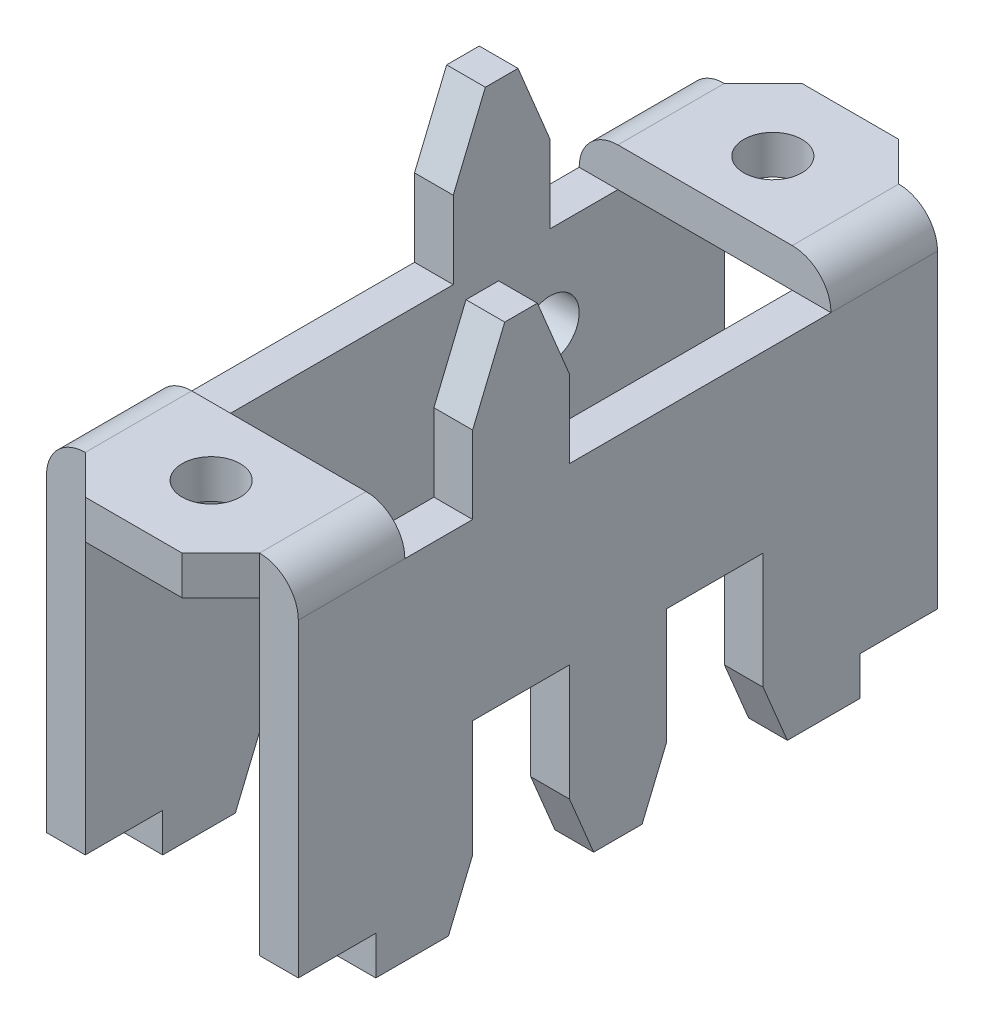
ISO-10303-21;
HEADER;
FILE_DESCRIPTION(('STEP AP214'),'2;1');
FILE_NAME('part.step','',(''),(''),'','','');
FILE_SCHEMA(('AUTOMOTIVE_DESIGN { 1 0 10303 214 1 1 1 1 }'));
ENDSEC;
DATA;
#1=APPLICATION_CONTEXT('core data for automotive mechanical design processes');
#2=APPLICATION_PROTOCOL_DEFINITION('international standard','automotive_design',2000,#1);
#3=PRODUCT_CONTEXT('',#1,'mechanical');
#4=PRODUCT('Part','Part','',(#3));
#5=PRODUCT_RELATED_PRODUCT_CATEGORY('part','',(#4));
#6=PRODUCT_DEFINITION_FORMATION('','',#4);
#7=PRODUCT_DEFINITION_CONTEXT('part definition',#1,'design');
#8=PRODUCT_DEFINITION('design','',#6,#7);
#9=PRODUCT_DEFINITION_SHAPE('','',#8);
#10=(LENGTH_UNIT() NAMED_UNIT(*) SI_UNIT(.MILLI.,.METRE.));
#11=(NAMED_UNIT(*) PLANE_ANGLE_UNIT() SI_UNIT($,.RADIAN.));
#12=(NAMED_UNIT(*) SI_UNIT($,.STERADIAN.) SOLID_ANGLE_UNIT());
#13=UNCERTAINTY_MEASURE_WITH_UNIT(LENGTH_MEASURE(1.E-05),#10,'distance_accuracy_value','');
#14=(GEOMETRIC_REPRESENTATION_CONTEXT(3) GLOBAL_UNCERTAINTY_ASSIGNED_CONTEXT((#13)) GLOBAL_UNIT_ASSIGNED_CONTEXT((#10,
#11,#12)) REPRESENTATION_CONTEXT('',''));
#15=CARTESIAN_POINT('',(0.,0.,0.));
#16=DIRECTION('',(0.,0.,1.));
#17=DIRECTION('',(1.,0.,0.));
#18=AXIS2_PLACEMENT_3D('',#15,#16,#17);
#19=CARTESIAN_POINT('',(-4.5,-2.,18.5));
#20=DIRECTION('',(0.,1.,0.));
#21=DIRECTION('',(0.,0.,1.));
#22=AXIS2_PLACEMENT_3D('',#19,#20,#21);
#23=PLANE('',#22);
#24=DIRECTION('',(0.,0.,-1.));
#25=VECTOR('',#24,1.);
#26=CARTESIAN_POINT('',(4.5,-2.,18.5));
#27=LINE('',#26,#25);
#28=CARTESIAN_POINT('',(4.5,-2.,2.5));
#29=VERTEX_POINT('',#28);
#30=CARTESIAN_POINT('',(4.5,-2.,-11.));
#31=VERTEX_POINT('',#30);
#32=EDGE_CURVE('E450',#29,#31,#27,.T.);
#33=ORIENTED_EDGE('',*,*,#32,.F.);
#34=DIRECTION('',(-1.,0.,0.));
#35=VECTOR('',#34,1.);
#36=CARTESIAN_POINT('',(6.5,-2.,2.5));
#37=LINE('',#36,#35);
#38=CARTESIAN_POINT('',(6.5,-2.,2.5));
#39=VERTEX_POINT('',#38);
#40=EDGE_CURVE('E435',#39,#29,#37,.T.);
#41=ORIENTED_EDGE('',*,*,#40,.F.);
#42=DIRECTION('',(0.,0.,1.));
#43=VECTOR('',#42,1.);
#44=CARTESIAN_POINT('',(6.5,-2.,11.));
#45=LINE('',#44,#43);
#46=CARTESIAN_POINT('',(6.5,-2.,-11.));
#47=VERTEX_POINT('',#46);
#48=EDGE_CURVE('E448',#47,#39,#45,.T.);
#49=ORIENTED_EDGE('',*,*,#48,.F.);
#50=DIRECTION('',(1.,0.,0.));
#51=VECTOR('',#50,1.);
#52=CARTESIAN_POINT('',(-6.5,-2.,-11.));
#53=LINE('',#52,#51);
#54=EDGE_CURVE('E457',#31,#47,#53,.T.);
#55=ORIENTED_EDGE('',*,*,#54,.F.);
#56=EDGE_LOOP('',(#33,#41,#49,#55));
#57=FACE_BOUND('',#56,.T.);
#58=ADVANCED_FACE('F30',(#57),#23,.T.);
#59=CARTESIAN_POINT('',(6.5,-2.,7.5));
#60=VERTEX_POINT('',#59);
#61=CARTESIAN_POINT('',(6.5,-2.00000000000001,11.));
#62=VERTEX_POINT('',#61);
#63=EDGE_CURVE('E458',#60,#62,#45,.T.);
#64=ORIENTED_EDGE('',*,*,#63,.F.);
#65=DIRECTION('',(1.,0.,0.));
#66=VECTOR('',#65,1.);
#67=CARTESIAN_POINT('',(6.5,-2.,7.5));
#68=LINE('',#67,#66);
#69=CARTESIAN_POINT('',(4.5,-2.,7.5));
#70=VERTEX_POINT('',#69);
#71=EDGE_CURVE('E451',#70,#60,#68,.T.);
#72=ORIENTED_EDGE('',*,*,#71,.F.);
#73=CARTESIAN_POINT('',(4.5,-2.,11.));
#74=VERTEX_POINT('',#73);
#75=EDGE_CURVE('E522',#74,#70,#27,.T.);
#76=ORIENTED_EDGE('',*,*,#75,.F.);
#77=DIRECTION('',(-1.,0.,0.));
#78=VECTOR('',#77,1.);
#79=CARTESIAN_POINT('',(-6.5,-2.,11.));
#80=LINE('',#79,#78);
#81=EDGE_CURVE('E479',#62,#74,#80,.T.);
#82=ORIENTED_EDGE('',*,*,#81,.F.);
#83=EDGE_LOOP('',(#64,#72,#76,#82));
#84=FACE_BOUND('',#83,.T.);
#85=ADVANCED_FACE('F996',(#84),#23,.T.);
#86=DIRECTION('',(0.,0.,-1.));
#87=VECTOR('',#86,1.);
#88=CARTESIAN_POINT('',(-6.5,-2.,11.));
#89=LINE('',#88,#87);
#90=CARTESIAN_POINT('',(-6.5,-2.,-7.5));
#91=VERTEX_POINT('',#90);
#92=CARTESIAN_POINT('',(-6.5,-2.00000000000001,-11.));
#93=VERTEX_POINT('',#92);
#94=EDGE_CURVE('E469',#91,#93,#89,.T.);
#95=ORIENTED_EDGE('',*,*,#94,.F.);
#96=DIRECTION('',(-1.,0.,0.));
#97=VECTOR('',#96,1.);
#98=CARTESIAN_POINT('',(-4.5,-2.,-7.5));
#99=LINE('',#98,#97);
#100=CARTESIAN_POINT('',(-4.5,-2.,-7.5));
#101=VERTEX_POINT('',#100);
#102=EDGE_CURVE('E442',#101,#91,#99,.T.);
#103=ORIENTED_EDGE('',*,*,#102,.F.);
#104=DIRECTION('',(0.,0.,-1.));
#105=VECTOR('',#104,1.);
#106=CARTESIAN_POINT('',(-4.5,-2.,18.5));
#107=LINE('',#106,#105);
#108=CARTESIAN_POINT('',(-4.5,-2.,-11.));
#109=VERTEX_POINT('',#108);
#110=EDGE_CURVE('E482',#101,#109,#107,.T.);
#111=ORIENTED_EDGE('',*,*,#110,.T.);
#112=EDGE_CURVE('E462',#93,#109,#53,.T.);
#113=ORIENTED_EDGE('',*,*,#112,.F.);
#114=EDGE_LOOP('',(#95,#103,#111,#113));
#115=FACE_BOUND('',#114,.T.);
#116=ADVANCED_FACE('F1052',(#115),#23,.T.);
#117=CARTESIAN_POINT('',(-4.5,-2.,11.));
#118=VERTEX_POINT('',#117);
#119=CARTESIAN_POINT('',(-4.5,-2.,-2.5));
#120=VERTEX_POINT('',#119);
#121=EDGE_CURVE('E484',#118,#120,#107,.T.);
#122=ORIENTED_EDGE('',*,*,#121,.T.);
#123=DIRECTION('',(1.,0.,0.));
#124=VECTOR('',#123,1.);
#125=CARTESIAN_POINT('',(-4.5,-2.,-2.5));
#126=LINE('',#125,#124);
#127=CARTESIAN_POINT('',(-6.5,-2.,-2.5));
#128=VERTEX_POINT('',#127);
#129=EDGE_CURVE('E642',#128,#120,#126,.T.);
#130=ORIENTED_EDGE('',*,*,#129,.F.);
#131=CARTESIAN_POINT('',(-6.5,-2.,11.));
#132=VERTEX_POINT('',#131);
#133=EDGE_CURVE('E470',#132,#128,#89,.T.);
#134=ORIENTED_EDGE('',*,*,#133,.F.);
#135=EDGE_CURVE('E473',#118,#132,#80,.T.);
#136=ORIENTED_EDGE('',*,*,#135,.F.);
#137=EDGE_LOOP('',(#122,#130,#134,#136));
#138=FACE_BOUND('',#137,.T.);
#139=ADVANCED_FACE('F1013',(#138),#23,.T.);
#140=CARTESIAN_POINT('',(-6.5,-20.,18.5));
#141=DIRECTION('',(0.,1.,0.));
#142=DIRECTION('',(-1.,0.,0.));
#143=AXIS2_PLACEMENT_3D('',#140,#141,#142);
#144=PLANE('',#143);
#145=DIRECTION('',(0.,0.,-1.));
#146=VECTOR('',#145,1.);
#147=CARTESIAN_POINT('',(-4.5,-20.,18.5));
#148=LINE('',#147,#146);
#149=CARTESIAN_POINT('',(-4.49999999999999,-20.,12.5));
#150=VERTEX_POINT('',#149);
#151=CARTESIAN_POINT('',(-4.49999999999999,-20.,8.75000000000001));
#152=VERTEX_POINT('',#151);
#153=EDGE_CURVE('E526',#150,#152,#148,.T.);
#154=ORIENTED_EDGE('',*,*,#153,.F.);
#155=DIRECTION('',(-1.,0.,0.));
#156=VECTOR('',#155,1.);
#157=CARTESIAN_POINT('',(6.5,-20.,12.5));
#158=LINE('',#157,#156);
#159=CARTESIAN_POINT('',(-6.5,-20.,12.5));
#160=VERTEX_POINT('',#159);
#161=EDGE_CURVE('E706',#150,#160,#158,.T.);
#162=ORIENTED_EDGE('',*,*,#161,.T.);
#163=DIRECTION('',(0.,0.,-1.));
#164=VECTOR('',#163,1.);
#165=CARTESIAN_POINT('',(-6.5,-20.,18.5));
#166=LINE('',#165,#164);
#167=CARTESIAN_POINT('',(-6.5,-20.,8.75000000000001));
#168=VERTEX_POINT('',#167);
#169=EDGE_CURVE('E530',#160,#168,#166,.T.);
#170=ORIENTED_EDGE('',*,*,#169,.T.);
#171=DIRECTION('',(-1.,0.,0.));
#172=VECTOR('',#171,1.);
#173=CARTESIAN_POINT('',(6.5,-20.,8.75000000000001));
#174=LINE('',#173,#172);
#175=EDGE_CURVE('E774',#152,#168,#174,.T.);
#176=ORIENTED_EDGE('',*,*,#175,.F.);
#177=EDGE_LOOP('',(#154,#162,#170,#176));
#178=FACE_BOUND('',#177,.T.);
#179=ADVANCED_FACE('F1121',(#178),#144,.F.);
#180=CARTESIAN_POINT('',(4.5,-20.,18.5));
#181=DIRECTION('',(0.,1.,0.));
#182=DIRECTION('',(-1.,0.,0.));
#183=AXIS2_PLACEMENT_3D('',#180,#181,#182);
#184=PLANE('',#183);
#185=DIRECTION('',(0.,0.,-1.));
#186=VECTOR('',#185,1.);
#187=CARTESIAN_POINT('',(6.5,-20.,18.5));
#188=LINE('',#187,#186);
#189=CARTESIAN_POINT('',(6.5,-20.,12.5));
#190=VERTEX_POINT('',#189);
#191=CARTESIAN_POINT('',(6.5,-20.,8.75000000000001));
#192=VERTEX_POINT('',#191);
#193=EDGE_CURVE('E511',#190,#192,#188,.T.);
#194=ORIENTED_EDGE('',*,*,#193,.F.);
#195=CARTESIAN_POINT('',(4.5,-20.,12.5));
#196=VERTEX_POINT('',#195);
#197=EDGE_CURVE('E717',#190,#196,#158,.T.);
#198=ORIENTED_EDGE('',*,*,#197,.T.);
#199=DIRECTION('',(0.,0.,-1.));
#200=VECTOR('',#199,1.);
#201=CARTESIAN_POINT('',(4.5,-20.,18.5));
#202=LINE('',#201,#200);
#203=CARTESIAN_POINT('',(4.5,-20.,8.75000000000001));
#204=VERTEX_POINT('',#203);
#205=EDGE_CURVE('E515',#196,#204,#202,.T.);
#206=ORIENTED_EDGE('',*,*,#205,.T.);
#207=EDGE_CURVE('E771',#192,#204,#174,.T.);
#208=ORIENTED_EDGE('',*,*,#207,.F.);
#209=EDGE_LOOP('',(#194,#198,#206,#208));
#210=FACE_BOUND('',#209,.T.);
#211=ADVANCED_FACE('F1125',(#210),#184,.F.);
#212=CARTESIAN_POINT('',(-4.5,-20.,1.25000000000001));
#213=VERTEX_POINT('',#212);
#214=CARTESIAN_POINT('',(-4.49999999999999,-20.,-1.25));
#215=VERTEX_POINT('',#214);
#216=EDGE_CURVE('E529',#213,#215,#148,.T.);
#217=ORIENTED_EDGE('',*,*,#216,.F.);
#218=DIRECTION('',(-1.,0.,0.));
#219=VECTOR('',#218,1.);
#220=CARTESIAN_POINT('',(6.5,-20.,1.25));
#221=LINE('',#220,#219);
#222=CARTESIAN_POINT('',(-6.5,-20.,1.25));
#223=VERTEX_POINT('',#222);
#224=EDGE_CURVE('E778',#213,#223,#221,.T.);
#225=ORIENTED_EDGE('',*,*,#224,.T.);
#226=CARTESIAN_POINT('',(-6.5,-20.,-1.25));
#227=VERTEX_POINT('',#226);
#228=EDGE_CURVE('E533',#223,#227,#166,.T.);
#229=ORIENTED_EDGE('',*,*,#228,.T.);
#230=DIRECTION('',(-1.,0.,0.));
#231=VECTOR('',#230,1.);
#232=CARTESIAN_POINT('',(6.5,-20.,-1.25));
#233=LINE('',#232,#231);
#234=EDGE_CURVE('E833',#215,#227,#233,.T.);
#235=ORIENTED_EDGE('',*,*,#234,.F.);
#236=EDGE_LOOP('',(#217,#225,#229,#235));
#237=FACE_BOUND('',#236,.T.);
#238=ADVANCED_FACE('F1074',(#237),#144,.F.);
#239=CARTESIAN_POINT('',(6.5,-20.,1.25));
#240=VERTEX_POINT('',#239);
#241=CARTESIAN_POINT('',(6.5,-20.,-1.25));
#242=VERTEX_POINT('',#241);
#243=EDGE_CURVE('E514',#240,#242,#188,.T.);
#244=ORIENTED_EDGE('',*,*,#243,.F.);
#245=CARTESIAN_POINT('',(4.5,-20.,1.25));
#246=VERTEX_POINT('',#245);
#247=EDGE_CURVE('E775',#240,#246,#221,.T.);
#248=ORIENTED_EDGE('',*,*,#247,.T.);
#249=CARTESIAN_POINT('',(4.5,-20.,-1.25));
#250=VERTEX_POINT('',#249);
#251=EDGE_CURVE('E518',#246,#250,#202,.T.);
#252=ORIENTED_EDGE('',*,*,#251,.T.);
#253=EDGE_CURVE('E830',#242,#250,#233,.T.);
#254=ORIENTED_EDGE('',*,*,#253,.F.);
#255=EDGE_LOOP('',(#244,#248,#252,#254));
#256=FACE_BOUND('',#255,.T.);
#257=ADVANCED_FACE('F1133',(#256),#184,.F.);
#258=CARTESIAN_POINT('',(4.5,-2.,18.5));
#259=DIRECTION('',(0.,0.,-1.));
#260=DIRECTION('',(-1.,0.,0.));
#261=AXIS2_PLACEMENT_3D('',#258,#259,#260);
#262=CYLINDRICAL_SURFACE('',#261,2.);
#263=DIRECTION('',(0.,0.,-1.));
#264=VECTOR('',#263,1.);
#265=CARTESIAN_POINT('',(6.5,-2.00000000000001,18.5));
#266=LINE('',#265,#264);
#267=CARTESIAN_POINT('',(6.5,-2.00000000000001,-16.5));
#268=VERTEX_POINT('',#267);
#269=EDGE_CURVE('E456',#47,#268,#266,.T.);
#270=ORIENTED_EDGE('',*,*,#269,.T.);
#271=CARTESIAN_POINT('',(4.5,-2.,-16.5));
#272=DIRECTION('',(0.,0.,1.));
#273=DIRECTION('',(1.,0.,0.));
#274=AXIS2_PLACEMENT_3D('',#271,#272,#273);
#275=CIRCLE('',#274,2.);
#276=CARTESIAN_POINT('',(4.49999999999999,0.,-16.5));
#277=VERTEX_POINT('',#276);
#278=EDGE_CURVE('E918',#268,#277,#275,.T.);
#279=ORIENTED_EDGE('',*,*,#278,.T.);
#280=DIRECTION('',(0.,0.,-1.));
#281=VECTOR('',#280,1.);
#282=CARTESIAN_POINT('',(4.49999999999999,0.,18.5));
#283=LINE('',#282,#281);
#284=CARTESIAN_POINT('',(4.49999999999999,0.,-11.));
#285=VERTEX_POINT('',#284);
#286=EDGE_CURVE('E539',#285,#277,#283,.T.);
#287=ORIENTED_EDGE('',*,*,#286,.F.);
#288=CARTESIAN_POINT('',(4.5,-2.,-11.));
#289=DIRECTION('',(0.,0.,-1.));
#290=DIRECTION('',(-1.,0.,0.));
#291=AXIS2_PLACEMENT_3D('',#288,#289,#290);
#292=CIRCLE('',#291,2.);
#293=EDGE_CURVE('E496',#285,#47,#292,.T.);
#294=ORIENTED_EDGE('',*,*,#293,.T.);
#295=EDGE_LOOP('',(#270,#279,#287,#294));
#296=FACE_BOUND('',#295,.T.);
#297=ADVANCED_FACE('F936',(#296),#262,.T.);
#298=CARTESIAN_POINT('',(-4.49999999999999,0.,18.5));
#299=DIRECTION('',(0.,-1.,0.));
#300=DIRECTION('',(0.,0.,-1.));
#301=AXIS2_PLACEMENT_3D('',#298,#299,#300);
#302=PLANE('',#301);
#303=CARTESIAN_POINT('',(0.,0.,-14.5));
#304=DIRECTION('',(0.,1.,0.));
#305=DIRECTION('',(0.,0.,1.));
#306=AXIS2_PLACEMENT_3D('',#303,#304,#305);
#307=CIRCLE('',#306,1.5);
#308=CARTESIAN_POINT('',(0.,0.,-13.));
#309=VERTEX_POINT('',#308);
#310=EDGE_CURVE('E465',#309,#309,#307,.T.);
#311=ORIENTED_EDGE('',*,*,#310,.F.);
#312=EDGE_LOOP('',(#311));
#313=FACE_BOUND('',#312,.T.);
#314=ORIENTED_EDGE('',*,*,#286,.T.);
#315=DIRECTION('',(0.707106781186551,0.,0.707106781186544));
#316=VECTOR('',#315,1.);
#317=CARTESIAN_POINT('',(4.49999999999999,0.,-16.5));
#318=LINE('',#317,#316);
#319=CARTESIAN_POINT('',(2.49999999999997,0.,-18.5));
#320=VERTEX_POINT('',#319);
#321=EDGE_CURVE('E899',#320,#277,#318,.T.);
#322=ORIENTED_EDGE('',*,*,#321,.F.);
#323=DIRECTION('',(-1.,0.,0.));
#324=VECTOR('',#323,1.);
#325=CARTESIAN_POINT('',(-4.49999999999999,0.,-18.5));
#326=LINE('',#325,#324);
#327=CARTESIAN_POINT('',(-2.49999999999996,0.,-18.5));
#328=VERTEX_POINT('',#327);
#329=EDGE_CURVE('E498',#320,#328,#326,.T.);
#330=ORIENTED_EDGE('',*,*,#329,.T.);
#331=DIRECTION('',(0.707106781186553,0.,-0.707106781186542));
#332=VECTOR('',#331,1.);
#333=CARTESIAN_POINT('',(-4.49999999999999,0.,-16.5));
#334=LINE('',#333,#332);
#335=CARTESIAN_POINT('',(-4.49999999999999,0.,-16.5));
#336=VERTEX_POINT('',#335);
#337=EDGE_CURVE('E557',#336,#328,#334,.T.);
#338=ORIENTED_EDGE('',*,*,#337,.F.);
#339=DIRECTION('',(0.,0.,-1.));
#340=VECTOR('',#339,1.);
#341=CARTESIAN_POINT('',(-4.49999999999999,0.,18.5));
#342=LINE('',#341,#340);
#343=CARTESIAN_POINT('',(-4.5,0.,-11.));
#344=VERTEX_POINT('',#343);
#345=EDGE_CURVE('E536',#344,#336,#342,.T.);
#346=ORIENTED_EDGE('',*,*,#345,.F.);
#347=DIRECTION('',(-1.,0.,0.));
#348=VECTOR('',#347,1.);
#349=CARTESIAN_POINT('',(-6.5,0.,-11.));
#350=LINE('',#349,#348);
#351=EDGE_CURVE('E463',#285,#344,#350,.T.);
#352=ORIENTED_EDGE('',*,*,#351,.F.);
#353=EDGE_LOOP('',(#314,#322,#330,#338,#346,#352));
#354=FACE_BOUND('',#353,.T.);
#355=ADVANCED_FACE('F932',(#313,#354),#302,.F.);
#356=CARTESIAN_POINT('',(-4.5,-2.,18.5));
#357=DIRECTION('',(0.,0.,-1.));
#358=DIRECTION('',(-1.,0.,0.));
#359=AXIS2_PLACEMENT_3D('',#356,#357,#358);
#360=CYLINDRICAL_SURFACE('',#359,2.);
#361=ORIENTED_EDGE('',*,*,#345,.T.);
#362=CARTESIAN_POINT('',(-4.5,-2.,-16.5));
#363=DIRECTION('',(0.,0.,1.));
#364=DIRECTION('',(1.,0.,0.));
#365=AXIS2_PLACEMENT_3D('',#362,#363,#364);
#366=CIRCLE('',#365,2.);
#367=CARTESIAN_POINT('',(-6.5,-2.00000000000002,-16.5));
#368=VERTEX_POINT('',#367);
#369=EDGE_CURVE('E920',#336,#368,#366,.T.);
#370=ORIENTED_EDGE('',*,*,#369,.T.);
#371=DIRECTION('',(0.,0.,-1.));
#372=VECTOR('',#371,1.);
#373=CARTESIAN_POINT('',(-6.5,-2.00000000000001,18.5));
#374=LINE('',#373,#372);
#375=EDGE_CURVE('E532',#93,#368,#374,.T.);
#376=ORIENTED_EDGE('',*,*,#375,.F.);
#377=CARTESIAN_POINT('',(-4.5,-2.,-11.));
#378=DIRECTION('',(0.,0.,-1.));
#379=DIRECTION('',(-1.,0.,0.));
#380=AXIS2_PLACEMENT_3D('',#377,#378,#379);
#381=CIRCLE('',#380,2.);
#382=EDGE_CURVE('E493',#93,#344,#381,.T.);
#383=ORIENTED_EDGE('',*,*,#382,.T.);
#384=EDGE_LOOP('',(#361,#370,#376,#383));
#385=FACE_BOUND('',#384,.T.);
#386=ADVANCED_FACE('F935',(#385),#360,.T.);
#387=CARTESIAN_POINT('',(-4.5,-2.,18.5));
#388=DIRECTION('',(0.,1.,0.));
#389=DIRECTION('',(0.,0.,1.));
#390=AXIS2_PLACEMENT_3D('',#387,#388,#389);
#391=PLANE('',#390);
#392=CARTESIAN_POINT('',(0.,-2.,-14.5));
#393=DIRECTION('',(0.,1.,0.));
#394=DIRECTION('',(0.,0.,1.));
#395=AXIS2_PLACEMENT_3D('',#392,#393,#394);
#396=CIRCLE('',#395,1.5);
#397=CARTESIAN_POINT('',(0.,-2.,-13.));
#398=VERTEX_POINT('',#397);
#399=EDGE_CURVE('E477',#398,#398,#396,.T.);
#400=ORIENTED_EDGE('',*,*,#399,.T.);
#401=EDGE_LOOP('',(#400));
#402=FACE_BOUND('',#401,.T.);
#403=DIRECTION('',(1.,0.,0.));
#404=VECTOR('',#403,1.);
#405=CARTESIAN_POINT('',(-4.5,-2.,-18.5));
#406=LINE('',#405,#404);
#407=CARTESIAN_POINT('',(-2.49999999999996,-2.,-18.5));
#408=VERTEX_POINT('',#407);
#409=CARTESIAN_POINT('',(2.49999999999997,-2.,-18.5));
#410=VERTEX_POINT('',#409);
#411=EDGE_CURVE('E503',#408,#410,#406,.T.);
#412=ORIENTED_EDGE('',*,*,#411,.T.);
#413=DIRECTION('',(0.707106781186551,0.,0.707106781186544));
#414=VECTOR('',#413,1.);
#415=CARTESIAN_POINT('',(17.4999999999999,-2.,-3.50000000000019));
#416=LINE('',#415,#414);
#417=CARTESIAN_POINT('',(4.49999999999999,-2.,-16.5));
#418=VERTEX_POINT('',#417);
#419=EDGE_CURVE('E915',#410,#418,#416,.T.);
#420=ORIENTED_EDGE('',*,*,#419,.T.);
#421=EDGE_CURVE('E517',#31,#418,#27,.T.);
#422=ORIENTED_EDGE('',*,*,#421,.F.);
#423=EDGE_CURVE('E460',#109,#31,#53,.T.);
#424=ORIENTED_EDGE('',*,*,#423,.F.);
#425=DIRECTION('',(0.,0.,-1.));
#426=VECTOR('',#425,1.);
#427=CARTESIAN_POINT('',(-4.5,-2.,18.5));
#428=LINE('',#427,#426);
#429=CARTESIAN_POINT('',(-4.49999999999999,-2.,-16.5));
#430=VERTEX_POINT('',#429);
#431=EDGE_CURVE('E521',#109,#430,#428,.T.);
#432=ORIENTED_EDGE('',*,*,#431,.T.);
#433=DIRECTION('',(0.707106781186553,0.,-0.707106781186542));
#434=VECTOR('',#433,1.);
#435=CARTESIAN_POINT('',(-22.,-2.,0.999999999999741));
#436=LINE('',#435,#434);
#437=EDGE_CURVE('E905',#430,#408,#436,.T.);
#438=ORIENTED_EDGE('',*,*,#437,.T.);
#439=EDGE_LOOP('',(#412,#420,#422,#424,#432,#438));
#440=FACE_BOUND('',#439,.T.);
#441=ADVANCED_FACE('F958',(#402,#440),#391,.F.);
#442=CARTESIAN_POINT('',(6.5,-2.00000000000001,18.5));
#443=DIRECTION('',(-1.,0.,0.));
#444=DIRECTION('',(0.,-1.,0.));
#445=AXIS2_PLACEMENT_3D('',#442,#443,#444);
#446=PLANE('',#445);
#447=DIRECTION('',(0.,-1.,0.));
#448=VECTOR('',#447,1.);
#449=CARTESIAN_POINT('',(6.5,6.,2.5));
#450=LINE('',#449,#448);
#451=CARTESIAN_POINT('',(6.5,1.99999999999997,2.5));
#452=VERTEX_POINT('',#451);
#453=EDGE_CURVE('E431',#452,#39,#450,.T.);
#454=ORIENTED_EDGE('',*,*,#453,.F.);
#455=DIRECTION('',(0.,-0.923879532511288,-0.382683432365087));
#456=VECTOR('',#455,1.);
#457=CARTESIAN_POINT('',(6.5,6.,4.15685424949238));
#458=LINE('',#457,#456);
#459=CARTESIAN_POINT('',(6.5,6.,4.15685424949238));
#460=VERTEX_POINT('',#459);
#461=EDGE_CURVE('E605',#452,#460,#458,.F.);
#462=ORIENTED_EDGE('',*,*,#461,.T.);
#463=DIRECTION('',(0.,0.,-1.));
#464=VECTOR('',#463,1.);
#465=CARTESIAN_POINT('',(6.5,6.,2.5));
#466=LINE('',#465,#464);
#467=CARTESIAN_POINT('',(6.5,6.,5.84314575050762));
#468=VERTEX_POINT('',#467);
#469=EDGE_CURVE('E1036',#468,#460,#466,.T.);
#470=ORIENTED_EDGE('',*,*,#469,.F.);
#471=DIRECTION('',(0.,0.923879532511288,-0.382683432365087));
#472=VECTOR('',#471,1.);
#473=CARTESIAN_POINT('',(6.5,6.,5.84314575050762));
#474=LINE('',#473,#472);
#475=CARTESIAN_POINT('',(6.5,1.99999999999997,7.5));
#476=VERTEX_POINT('',#475);
#477=EDGE_CURVE('E603',#468,#476,#474,.F.);
#478=ORIENTED_EDGE('',*,*,#477,.T.);
#479=DIRECTION('',(0.,-1.,0.));
#480=VECTOR('',#479,1.);
#481=CARTESIAN_POINT('',(6.5,6.,7.5));
#482=LINE('',#481,#480);
#483=EDGE_CURVE('E1029',#476,#60,#482,.T.);
#484=ORIENTED_EDGE('',*,*,#483,.T.);
#485=ORIENTED_EDGE('',*,*,#63,.T.);
#486=CARTESIAN_POINT('',(6.5,-2.,16.5));
#487=VERTEX_POINT('',#486);
#488=EDGE_CURVE('E542',#487,#62,#266,.T.);
#489=ORIENTED_EDGE('',*,*,#488,.F.);
#490=DIRECTION('',(0.,1.,0.));
#491=VECTOR('',#490,1.);
#492=CARTESIAN_POINT('',(6.5,-20.,16.5));
#493=LINE('',#492,#491);
#494=CARTESIAN_POINT('',(6.5,-18.,16.5));
#495=VERTEX_POINT('',#494);
#496=EDGE_CURVE('E882',#495,#487,#493,.T.);
#497=ORIENTED_EDGE('',*,*,#496,.F.);
#498=DIRECTION('',(0.,0.,-1.));
#499=VECTOR('',#498,1.);
#500=CARTESIAN_POINT('',(6.5,-18.,12.5));
#501=LINE('',#500,#499);
#502=CARTESIAN_POINT('',(6.5,-18.,12.5));
#503=VERTEX_POINT('',#502);
#504=EDGE_CURVE('E702',#495,#503,#501,.T.);
#505=ORIENTED_EDGE('',*,*,#504,.T.);
#506=DIRECTION('',(0.,-1.,0.));
#507=VECTOR('',#506,1.);
#508=CARTESIAN_POINT('',(6.5,-20.,12.5));
#509=LINE('',#508,#507);
#510=EDGE_CURVE('E699',#503,#190,#509,.T.);
#511=ORIENTED_EDGE('',*,*,#510,.T.);
#512=ORIENTED_EDGE('',*,*,#193,.T.);
#513=DIRECTION('',(0.,0.923076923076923,-0.384615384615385));
#514=VECTOR('',#513,1.);
#515=CARTESIAN_POINT('',(6.5,-17.,7.50000000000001));
#516=LINE('',#515,#514);
#517=CARTESIAN_POINT('',(6.5,-17.,7.50000000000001));
#518=VERTEX_POINT('',#517);
#519=EDGE_CURVE('E736',#192,#518,#516,.T.);
#520=ORIENTED_EDGE('',*,*,#519,.T.);
#521=DIRECTION('',(0.,1.,0.));
#522=VECTOR('',#521,1.);
#523=CARTESIAN_POINT('',(6.5,-17.,7.50000000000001));
#524=LINE('',#523,#522);
#525=CARTESIAN_POINT('',(6.5,-11.,7.5));
#526=VERTEX_POINT('',#525);
#527=EDGE_CURVE('E739',#518,#526,#524,.T.);
#528=ORIENTED_EDGE('',*,*,#527,.T.);
#529=DIRECTION('',(0.,0.,-1.));
#530=VECTOR('',#529,1.);
#531=CARTESIAN_POINT('',(6.5,-11.,7.5));
#532=LINE('',#531,#530);
#533=CARTESIAN_POINT('',(6.5,-11.,2.5));
#534=VERTEX_POINT('',#533);
#535=EDGE_CURVE('E742',#526,#534,#532,.T.);
#536=ORIENTED_EDGE('',*,*,#535,.T.);
#537=DIRECTION('',(0.,-1.,0.));
#538=VECTOR('',#537,1.);
#539=CARTESIAN_POINT('',(6.5,-17.,2.5));
#540=LINE('',#539,#538);
#541=CARTESIAN_POINT('',(6.5,-17.,2.5));
#542=VERTEX_POINT('',#541);
#543=EDGE_CURVE('E729',#534,#542,#540,.T.);
#544=ORIENTED_EDGE('',*,*,#543,.T.);
#545=DIRECTION('',(0.,-0.923076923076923,-0.384615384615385));
#546=VECTOR('',#545,1.);
#547=CARTESIAN_POINT('',(6.5,-17.,2.5));
#548=LINE('',#547,#546);
#549=EDGE_CURVE('E732',#542,#240,#548,.T.);
#550=ORIENTED_EDGE('',*,*,#549,.T.);
#551=ORIENTED_EDGE('',*,*,#243,.T.);
#552=DIRECTION('',(0.,0.923076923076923,-0.384615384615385));
#553=VECTOR('',#552,1.);
#554=CARTESIAN_POINT('',(6.5,-17.,-2.5));
#555=LINE('',#554,#553);
#556=CARTESIAN_POINT('',(6.5,-17.,-2.5));
#557=VERTEX_POINT('',#556);
#558=EDGE_CURVE('E809',#242,#557,#555,.T.);
#559=ORIENTED_EDGE('',*,*,#558,.T.);
#560=DIRECTION('',(0.,1.,0.));
#561=VECTOR('',#560,1.);
#562=CARTESIAN_POINT('',(6.5,-17.,-2.5));
#563=LINE('',#562,#561);
#564=CARTESIAN_POINT('',(6.5,-11.,-2.5));
#565=VERTEX_POINT('',#564);
#566=EDGE_CURVE('E796',#557,#565,#563,.T.);
#567=ORIENTED_EDGE('',*,*,#566,.T.);
#568=DIRECTION('',(0.,0.,-1.));
#569=VECTOR('',#568,1.);
#570=CARTESIAN_POINT('',(6.5,-11.,-7.5));
#571=LINE('',#570,#569);
#572=CARTESIAN_POINT('',(6.5,-11.,-7.5));
#573=VERTEX_POINT('',#572);
#574=EDGE_CURVE('E799',#565,#573,#571,.T.);
#575=ORIENTED_EDGE('',*,*,#574,.T.);
#576=DIRECTION('',(0.,-1.,0.));
#577=VECTOR('',#576,1.);
#578=CARTESIAN_POINT('',(6.5,-17.,-7.5));
#579=LINE('',#578,#577);
#580=CARTESIAN_POINT('',(6.5,-17.,-7.5));
#581=VERTEX_POINT('',#580);
#582=EDGE_CURVE('E803',#573,#581,#579,.T.);
#583=ORIENTED_EDGE('',*,*,#582,.T.);
#584=DIRECTION('',(0.,-0.923076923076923,-0.384615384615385));
#585=VECTOR('',#584,1.);
#586=CARTESIAN_POINT('',(6.5,-17.,-7.5));
#587=LINE('',#586,#585);
#588=CARTESIAN_POINT('',(6.5,-20.,-8.75));
#589=VERTEX_POINT('',#588);
#590=EDGE_CURVE('E806',#581,#589,#587,.T.);
#591=ORIENTED_EDGE('',*,*,#590,.T.);
#592=CARTESIAN_POINT('',(6.5,-20.,-12.5));
#593=VERTEX_POINT('',#592);
#594=EDGE_CURVE('E506',#589,#593,#188,.T.);
#595=ORIENTED_EDGE('',*,*,#594,.T.);
#596=DIRECTION('',(0.,1.,0.));
#597=VECTOR('',#596,1.);
#598=CARTESIAN_POINT('',(6.5,-20.,-12.5));
#599=LINE('',#598,#597);
#600=CARTESIAN_POINT('',(6.5,-18.,-12.5));
#601=VERTEX_POINT('',#600);
#602=EDGE_CURVE('E665',#593,#601,#599,.T.);
#603=ORIENTED_EDGE('',*,*,#602,.T.);
#604=DIRECTION('',(0.,0.,-1.));
#605=VECTOR('',#604,1.);
#606=CARTESIAN_POINT('',(6.5,-18.,-12.5));
#607=LINE('',#606,#605);
#608=CARTESIAN_POINT('',(6.5,-18.,-16.5));
#609=VERTEX_POINT('',#608);
#610=EDGE_CURVE('E668',#601,#609,#607,.T.);
#611=ORIENTED_EDGE('',*,*,#610,.T.);
#612=DIRECTION('',(0.,1.,0.));
#613=VECTOR('',#612,1.);
#614=CARTESIAN_POINT('',(6.5,-20.,-16.5));
#615=LINE('',#614,#613);
#616=EDGE_CURVE('E903',#609,#268,#615,.T.);
#617=ORIENTED_EDGE('',*,*,#616,.T.);
#618=ORIENTED_EDGE('',*,*,#269,.F.);
#619=ORIENTED_EDGE('',*,*,#48,.T.);
#620=EDGE_LOOP('',(#454,#462,#470,#478,#484,#485,#489,#497,#505,#511,#512,#520,#528,#536,#544,
#550,#551,#559,#567,#575,#583,#591,#595,#603,#611,#617,#618,#619));
#621=FACE_BOUND('',#620,.T.);
#622=ADVANCED_FACE('F454',(#621),#446,.F.);
#623=CARTESIAN_POINT('',(4.49999999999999,0.,16.5));
#624=VERTEX_POINT('',#623);
#625=CARTESIAN_POINT('',(4.49999999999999,0.,11.));
#626=VERTEX_POINT('',#625);
#627=EDGE_CURVE('E540',#624,#626,#283,.T.);
#628=ORIENTED_EDGE('',*,*,#627,.F.);
#629=CARTESIAN_POINT('',(4.5,-2.,16.5));
#630=DIRECTION('',(0.,0.,-1.));
#631=DIRECTION('',(-1.,0.,0.));
#632=AXIS2_PLACEMENT_3D('',#629,#630,#631);
#633=CIRCLE('',#632,2.);
#634=EDGE_CURVE('E890',#624,#487,#633,.T.);
#635=ORIENTED_EDGE('',*,*,#634,.T.);
#636=ORIENTED_EDGE('',*,*,#488,.T.);
#637=CARTESIAN_POINT('',(4.5,-2.,11.));
#638=DIRECTION('',(0.,0.,1.));
#639=DIRECTION('',(1.,0.,0.));
#640=AXIS2_PLACEMENT_3D('',#637,#638,#639);
#641=CIRCLE('',#640,2.);
#642=EDGE_CURVE('E490',#62,#626,#641,.T.);
#643=ORIENTED_EDGE('',*,*,#642,.T.);
#644=EDGE_LOOP('',(#628,#635,#636,#643));
#645=FACE_BOUND('',#644,.T.);
#646=ADVANCED_FACE('F1025',(#645),#262,.T.);
#647=CARTESIAN_POINT('',(0.,0.,14.5));
#648=DIRECTION('',(0.,1.,0.));
#649=DIRECTION('',(0.,0.,-1.));
#650=AXIS2_PLACEMENT_3D('',#647,#648,#649);
#651=CIRCLE('',#650,1.5);
#652=CARTESIAN_POINT('',(0.,0.,13.));
#653=VERTEX_POINT('',#652);
#654=EDGE_CURVE('E558',#653,#653,#651,.T.);
#655=ORIENTED_EDGE('',*,*,#654,.F.);
#656=EDGE_LOOP('',(#655));
#657=FACE_BOUND('',#656,.T.);
#658=CARTESIAN_POINT('',(-4.49999999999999,0.,16.5));
#659=VERTEX_POINT('',#658);
#660=CARTESIAN_POINT('',(-4.5,0.,11.));
#661=VERTEX_POINT('',#660);
#662=EDGE_CURVE('E537',#659,#661,#342,.T.);
#663=ORIENTED_EDGE('',*,*,#662,.F.);
#664=DIRECTION('',(-0.707106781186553,0.,-0.707106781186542));
#665=VECTOR('',#664,1.);
#666=CARTESIAN_POINT('',(-4.49999999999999,0.,16.5));
#667=LINE('',#666,#665);
#668=CARTESIAN_POINT('',(-2.49999999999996,0.,18.5));
#669=VERTEX_POINT('',#668);
#670=EDGE_CURVE('E871',#669,#659,#667,.T.);
#671=ORIENTED_EDGE('',*,*,#670,.F.);
#672=DIRECTION('',(-1.,0.,0.));
#673=VECTOR('',#672,1.);
#674=CARTESIAN_POINT('',(-4.49999999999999,0.,18.5));
#675=LINE('',#674,#673);
#676=CARTESIAN_POINT('',(2.49999999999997,0.,18.5));
#677=VERTEX_POINT('',#676);
#678=EDGE_CURVE('E499',#677,#669,#675,.T.);
#679=ORIENTED_EDGE('',*,*,#678,.F.);
#680=DIRECTION('',(-0.707106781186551,0.,0.707106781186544));
#681=VECTOR('',#680,1.);
#682=CARTESIAN_POINT('',(4.49999999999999,0.,16.5));
#683=LINE('',#682,#681);
#684=EDGE_CURVE('E869',#624,#677,#683,.T.);
#685=ORIENTED_EDGE('',*,*,#684,.F.);
#686=ORIENTED_EDGE('',*,*,#627,.T.);
#687=DIRECTION('',(1.,0.,0.));
#688=VECTOR('',#687,1.);
#689=CARTESIAN_POINT('',(-6.5,0.,11.));
#690=LINE('',#689,#688);
#691=EDGE_CURVE('E474',#661,#626,#690,.T.);
#692=ORIENTED_EDGE('',*,*,#691,.F.);
#693=EDGE_LOOP('',(#663,#671,#679,#685,#686,#692));
#694=FACE_BOUND('',#693,.T.);
#695=ADVANCED_FACE('F938',(#657,#694),#302,.F.);
#696=CARTESIAN_POINT('',(-6.5,-2.00000000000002,16.5));
#697=VERTEX_POINT('',#696);
#698=EDGE_CURVE('E534',#697,#132,#374,.T.);
#699=ORIENTED_EDGE('',*,*,#698,.F.);
#700=CARTESIAN_POINT('',(-4.5,-2.,16.5));
#701=DIRECTION('',(0.,0.,-1.));
#702=DIRECTION('',(-1.,0.,0.));
#703=AXIS2_PLACEMENT_3D('',#700,#701,#702);
#704=CIRCLE('',#703,2.);
#705=EDGE_CURVE('E893',#697,#659,#704,.T.);
#706=ORIENTED_EDGE('',*,*,#705,.T.);
#707=ORIENTED_EDGE('',*,*,#662,.T.);
#708=CARTESIAN_POINT('',(-4.5,-2.,11.));
#709=DIRECTION('',(0.,0.,1.));
#710=DIRECTION('',(1.,0.,0.));
#711=AXIS2_PLACEMENT_3D('',#708,#709,#710);
#712=CIRCLE('',#711,2.);
#713=EDGE_CURVE('E487',#661,#132,#712,.T.);
#714=ORIENTED_EDGE('',*,*,#713,.T.);
#715=EDGE_LOOP('',(#699,#706,#707,#714));
#716=FACE_BOUND('',#715,.T.);
#717=ADVANCED_FACE('F1016',(#716),#360,.T.);
#718=CARTESIAN_POINT('',(-6.5,-2.00000000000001,18.5));
#719=DIRECTION('',(1.,0.,0.));
#720=DIRECTION('',(0.,1.,0.));
#721=AXIS2_PLACEMENT_3D('',#718,#719,#720);
#722=PLANE('',#721);
#723=CARTESIAN_POINT('',(-6.5,-6.5,7.5));
#724=DIRECTION('',(-1.,0.,0.));
#725=DIRECTION('',(0.,-1.,0.));
#726=AXIS2_PLACEMENT_3D('',#723,#724,#725);
#727=CIRCLE('',#726,1.5);
#728=CARTESIAN_POINT('',(-6.5,-8.,7.5));
#729=VERTEX_POINT('',#728);
#730=EDGE_CURVE('E652',#729,#729,#727,.T.);
#731=ORIENTED_EDGE('',*,*,#730,.F.);
#732=EDGE_LOOP('',(#731));
#733=FACE_BOUND('',#732,.T.);
#734=CARTESIAN_POINT('',(-6.5,-6.5,-7.5));
#735=DIRECTION('',(-1.,0.,0.));
#736=DIRECTION('',(0.,-1.,0.));
#737=AXIS2_PLACEMENT_3D('',#734,#735,#736);
#738=CIRCLE('',#737,1.5);
#739=CARTESIAN_POINT('',(-6.5,-8.,-7.5));
#740=VERTEX_POINT('',#739);
#741=EDGE_CURVE('E658',#740,#740,#738,.T.);
#742=ORIENTED_EDGE('',*,*,#741,.F.);
#743=EDGE_LOOP('',(#742));
#744=FACE_BOUND('',#743,.T.);
#745=DIRECTION('',(0.,-1.,0.));
#746=VECTOR('',#745,1.);
#747=CARTESIAN_POINT('',(-6.5,6.,-2.5));
#748=LINE('',#747,#746);
#749=CARTESIAN_POINT('',(-6.5,1.99999999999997,-2.5));
#750=VERTEX_POINT('',#749);
#751=EDGE_CURVE('E624',#750,#128,#748,.T.);
#752=ORIENTED_EDGE('',*,*,#751,.F.);
#753=DIRECTION('',(0.,-0.923879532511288,0.382683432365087));
#754=VECTOR('',#753,1.);
#755=CARTESIAN_POINT('',(-6.5,6.,-4.15685424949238));
#756=LINE('',#755,#754);
#757=CARTESIAN_POINT('',(-6.5,6.,-4.15685424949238));
#758=VERTEX_POINT('',#757);
#759=EDGE_CURVE('E38',#750,#758,#756,.F.);
#760=ORIENTED_EDGE('',*,*,#759,.T.);
#761=DIRECTION('',(0.,0.,1.));
#762=VECTOR('',#761,1.);
#763=CARTESIAN_POINT('',(-6.5,6.,-7.5));
#764=LINE('',#763,#762);
#765=CARTESIAN_POINT('',(-6.5,6.,-5.84314575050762));
#766=VERTEX_POINT('',#765);
#767=EDGE_CURVE('E623',#766,#758,#764,.T.);
#768=ORIENTED_EDGE('',*,*,#767,.F.);
#769=DIRECTION('',(0.,0.923879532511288,0.382683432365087));
#770=VECTOR('',#769,1.);
#771=CARTESIAN_POINT('',(-6.5,6.,-5.84314575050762));
#772=LINE('',#771,#770);
#773=CARTESIAN_POINT('',(-6.5,1.99999999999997,-7.5));
#774=VERTEX_POINT('',#773);
#775=EDGE_CURVE('E45',#766,#774,#772,.F.);
#776=ORIENTED_EDGE('',*,*,#775,.T.);
#777=DIRECTION('',(0.,-1.,0.));
#778=VECTOR('',#777,1.);
#779=CARTESIAN_POINT('',(-6.5,6.,-7.5));
#780=LINE('',#779,#778);
#781=EDGE_CURVE('E644',#774,#91,#780,.T.);
#782=ORIENTED_EDGE('',*,*,#781,.T.);
#783=ORIENTED_EDGE('',*,*,#94,.T.);
#784=ORIENTED_EDGE('',*,*,#375,.T.);
#785=DIRECTION('',(0.,1.,0.));
#786=VECTOR('',#785,1.);
#787=CARTESIAN_POINT('',(-6.5,-20.,-16.5));
#788=LINE('',#787,#786);
#789=CARTESIAN_POINT('',(-6.5,-18.,-16.5));
#790=VERTEX_POINT('',#789);
#791=EDGE_CURVE('E902',#790,#368,#788,.T.);
#792=ORIENTED_EDGE('',*,*,#791,.F.);
#793=DIRECTION('',(0.,0.,-1.));
#794=VECTOR('',#793,1.);
#795=CARTESIAN_POINT('',(-6.5,-18.,-12.5));
#796=LINE('',#795,#794);
#797=CARTESIAN_POINT('',(-6.5,-18.,-12.5));
#798=VERTEX_POINT('',#797);
#799=EDGE_CURVE('E669',#798,#790,#796,.T.);
#800=ORIENTED_EDGE('',*,*,#799,.F.);
#801=DIRECTION('',(0.,1.,0.));
#802=VECTOR('',#801,1.);
#803=CARTESIAN_POINT('',(-6.5,-20.,-12.5));
#804=LINE('',#803,#802);
#805=CARTESIAN_POINT('',(-6.5,-20.,-12.5));
#806=VERTEX_POINT('',#805);
#807=EDGE_CURVE('E664',#806,#798,#804,.T.);
#808=ORIENTED_EDGE('',*,*,#807,.F.);
#809=CARTESIAN_POINT('',(-6.5,-20.,-8.75));
#810=VERTEX_POINT('',#809);
#811=EDGE_CURVE('E528',#810,#806,#166,.T.);
#812=ORIENTED_EDGE('',*,*,#811,.F.);
#813=DIRECTION('',(0.,-0.923076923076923,-0.384615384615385));
#814=VECTOR('',#813,1.);
#815=CARTESIAN_POINT('',(-6.5,-17.,-7.5));
#816=LINE('',#815,#814);
#817=CARTESIAN_POINT('',(-6.5,-17.,-7.5));
#818=VERTEX_POINT('',#817);
#819=EDGE_CURVE('E821',#818,#810,#816,.T.);
#820=ORIENTED_EDGE('',*,*,#819,.F.);
#821=DIRECTION('',(0.,-1.,0.));
#822=VECTOR('',#821,1.);
#823=CARTESIAN_POINT('',(-6.5,-17.,-7.5));
#824=LINE('',#823,#822);
#825=CARTESIAN_POINT('',(-6.5,-11.,-7.5));
#826=VERTEX_POINT('',#825);
#827=EDGE_CURVE('E818',#826,#818,#824,.T.);
#828=ORIENTED_EDGE('',*,*,#827,.F.);
#829=DIRECTION('',(0.,0.,-1.));
#830=VECTOR('',#829,1.);
#831=CARTESIAN_POINT('',(-6.5,-11.,-7.5));
#832=LINE('',#831,#830);
#833=CARTESIAN_POINT('',(-6.5,-11.,-2.5));
#834=VERTEX_POINT('',#833);
#835=EDGE_CURVE('E815',#834,#826,#832,.T.);
#836=ORIENTED_EDGE('',*,*,#835,.F.);
#837=DIRECTION('',(0.,1.,0.));
#838=VECTOR('',#837,1.);
#839=CARTESIAN_POINT('',(-6.5,-17.,-2.5));
#840=LINE('',#839,#838);
#841=CARTESIAN_POINT('',(-6.5,-17.,-2.5));
#842=VERTEX_POINT('',#841);
#843=EDGE_CURVE('E795',#842,#834,#840,.T.);
#844=ORIENTED_EDGE('',*,*,#843,.F.);
#845=DIRECTION('',(0.,0.923076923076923,-0.384615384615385));
#846=VECTOR('',#845,1.);
#847=CARTESIAN_POINT('',(-6.5,-17.,-2.5));
#848=LINE('',#847,#846);
#849=EDGE_CURVE('E800',#227,#842,#848,.T.);
#850=ORIENTED_EDGE('',*,*,#849,.F.);
#851=ORIENTED_EDGE('',*,*,#228,.F.);
#852=DIRECTION('',(0.,-0.923076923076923,-0.384615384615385));
#853=VECTOR('',#852,1.);
#854=CARTESIAN_POINT('',(-6.5,-17.,2.5));
#855=LINE('',#854,#853);
#856=CARTESIAN_POINT('',(-6.5,-17.,2.5));
#857=VERTEX_POINT('',#856);
#858=EDGE_CURVE('E748',#857,#223,#855,.T.);
#859=ORIENTED_EDGE('',*,*,#858,.F.);
#860=DIRECTION('',(0.,-1.,0.));
#861=VECTOR('',#860,1.);
#862=CARTESIAN_POINT('',(-6.5,-17.,2.5));
#863=LINE('',#862,#861);
#864=CARTESIAN_POINT('',(-6.5,-11.,2.5));
#865=VERTEX_POINT('',#864);
#866=EDGE_CURVE('E728',#865,#857,#863,.T.);
#867=ORIENTED_EDGE('',*,*,#866,.F.);
#868=DIRECTION('',(0.,0.,-1.));
#869=VECTOR('',#868,1.);
#870=CARTESIAN_POINT('',(-6.5,-11.,7.5));
#871=LINE('',#870,#869);
#872=CARTESIAN_POINT('',(-6.5,-11.,7.5));
#873=VERTEX_POINT('',#872);
#874=EDGE_CURVE('E733',#873,#865,#871,.T.);
#875=ORIENTED_EDGE('',*,*,#874,.F.);
#876=DIRECTION('',(0.,1.,0.));
#877=VECTOR('',#876,1.);
#878=CARTESIAN_POINT('',(-6.5,-17.,7.50000000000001));
#879=LINE('',#878,#877);
#880=CARTESIAN_POINT('',(-6.5,-17.,7.50000000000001));
#881=VERTEX_POINT('',#880);
#882=EDGE_CURVE('E753',#881,#873,#879,.T.);
#883=ORIENTED_EDGE('',*,*,#882,.F.);
#884=DIRECTION('',(0.,0.923076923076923,-0.384615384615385));
#885=VECTOR('',#884,1.);
#886=CARTESIAN_POINT('',(-6.5,-17.,7.50000000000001));
#887=LINE('',#886,#885);
#888=EDGE_CURVE('E750',#168,#881,#887,.T.);
#889=ORIENTED_EDGE('',*,*,#888,.F.);
#890=ORIENTED_EDGE('',*,*,#169,.F.);
#891=DIRECTION('',(0.,-1.,0.));
#892=VECTOR('',#891,1.);
#893=CARTESIAN_POINT('',(-6.5,-20.,12.5));
#894=LINE('',#893,#892);
#895=CARTESIAN_POINT('',(-6.5,-18.,12.5));
#896=VERTEX_POINT('',#895);
#897=EDGE_CURVE('E698',#896,#160,#894,.T.);
#898=ORIENTED_EDGE('',*,*,#897,.F.);
#899=DIRECTION('',(0.,0.,-1.));
#900=VECTOR('',#899,1.);
#901=CARTESIAN_POINT('',(-6.5,-18.,12.5));
#902=LINE('',#901,#900);
#903=CARTESIAN_POINT('',(-6.5,-18.,16.5));
#904=VERTEX_POINT('',#903);
#905=EDGE_CURVE('E703',#904,#896,#902,.T.);
#906=ORIENTED_EDGE('',*,*,#905,.F.);
#907=DIRECTION('',(0.,1.,0.));
#908=VECTOR('',#907,1.);
#909=CARTESIAN_POINT('',(-6.5,-20.,16.5));
#910=LINE('',#909,#908);
#911=EDGE_CURVE('E874',#904,#697,#910,.T.);
#912=ORIENTED_EDGE('',*,*,#911,.T.);
#913=ORIENTED_EDGE('',*,*,#698,.T.);
#914=ORIENTED_EDGE('',*,*,#133,.T.);
#915=EDGE_LOOP('',(#752,#760,#768,#776,#782,#783,#784,#792,#800,#808,#812,#820,#828,#836,#844,
#850,#851,#859,#867,#875,#883,#889,#890,#898,#906,#912,#913,#914));
#916=FACE_BOUND('',#915,.T.);
#917=ADVANCED_FACE('F622',(#733,#744,#916),#722,.F.);
#918=ORIENTED_EDGE('',*,*,#811,.T.);
#919=DIRECTION('',(-1.,0.,0.));
#920=VECTOR('',#919,1.);
#921=CARTESIAN_POINT('',(6.5,-20.,-12.5));
#922=LINE('',#921,#920);
#923=CARTESIAN_POINT('',(-4.49999999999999,-20.,-12.5));
#924=VERTEX_POINT('',#923);
#925=EDGE_CURVE('E679',#924,#806,#922,.T.);
#926=ORIENTED_EDGE('',*,*,#925,.F.);
#927=CARTESIAN_POINT('',(-4.49999999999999,-20.,-8.75));
#928=VERTEX_POINT('',#927);
#929=EDGE_CURVE('E525',#928,#924,#148,.T.);
#930=ORIENTED_EDGE('',*,*,#929,.F.);
#931=DIRECTION('',(-1.,0.,0.));
#932=VECTOR('',#931,1.);
#933=CARTESIAN_POINT('',(6.5,-20.,-8.75));
#934=LINE('',#933,#932);
#935=EDGE_CURVE('E837',#928,#810,#934,.T.);
#936=ORIENTED_EDGE('',*,*,#935,.T.);
#937=EDGE_LOOP('',(#918,#926,#930,#936));
#938=FACE_BOUND('',#937,.T.);
#939=ADVANCED_FACE('F1066',(#938),#144,.F.);
#940=CARTESIAN_POINT('',(-4.5,-20.,18.5));
#941=DIRECTION('',(-1.,0.,0.));
#942=DIRECTION('',(0.,0.,1.));
#943=AXIS2_PLACEMENT_3D('',#940,#941,#942);
#944=PLANE('',#943);
#945=CARTESIAN_POINT('',(-4.5,-6.5,7.5));
#946=DIRECTION('',(-1.,0.,0.));
#947=DIRECTION('',(0.,0.,1.));
#948=AXIS2_PLACEMENT_3D('',#945,#946,#947);
#949=CIRCLE('',#948,1.5);
#950=CARTESIAN_POINT('',(-4.5,-6.5,9.));
#951=VERTEX_POINT('',#950);
#952=EDGE_CURVE('E655',#951,#951,#949,.F.);
#953=ORIENTED_EDGE('',*,*,#952,.F.);
#954=EDGE_LOOP('',(#953));
#955=FACE_BOUND('',#954,.T.);
#956=CARTESIAN_POINT('',(-4.5,-6.5,-7.5));
#957=DIRECTION('',(-1.,0.,0.));
#958=DIRECTION('',(0.,0.,1.));
#959=AXIS2_PLACEMENT_3D('',#956,#957,#958);
#960=CIRCLE('',#959,1.5);
#961=CARTESIAN_POINT('',(-4.5,-6.5,-6.));
#962=VERTEX_POINT('',#961);
#963=EDGE_CURVE('E661',#962,#962,#960,.F.);
#964=ORIENTED_EDGE('',*,*,#963,.F.);
#965=EDGE_LOOP('',(#964));
#966=FACE_BOUND('',#965,.T.);
#967=DIRECTION('',(0.,0.,-1.));
#968=VECTOR('',#967,1.);
#969=CARTESIAN_POINT('',(-4.5,6.,-7.5));
#970=LINE('',#969,#968);
#971=CARTESIAN_POINT('',(-4.5,6.,-4.15685424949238));
#972=VERTEX_POINT('',#971);
#973=CARTESIAN_POINT('',(-4.5,6.,-5.84314575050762));
#974=VERTEX_POINT('',#973);
#975=EDGE_CURVE('E633',#972,#974,#970,.T.);
#976=ORIENTED_EDGE('',*,*,#975,.F.);
#977=DIRECTION('',(0.,0.923879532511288,-0.382683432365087));
#978=VECTOR('',#977,1.);
#979=CARTESIAN_POINT('',(-4.5,6.,-4.15685424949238));
#980=LINE('',#979,#978);
#981=CARTESIAN_POINT('',(-4.5,1.99999999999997,-2.5));
#982=VERTEX_POINT('',#981);
#983=EDGE_CURVE('E617',#972,#982,#980,.F.);
#984=ORIENTED_EDGE('',*,*,#983,.T.);
#985=DIRECTION('',(0.,-1.,0.));
#986=VECTOR('',#985,1.);
#987=CARTESIAN_POINT('',(-4.5,6.,-2.5));
#988=LINE('',#987,#986);
#989=EDGE_CURVE('E632',#982,#120,#988,.T.);
#990=ORIENTED_EDGE('',*,*,#989,.T.);
#991=ORIENTED_EDGE('',*,*,#121,.F.);
#992=CARTESIAN_POINT('',(-4.49999999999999,-2.,16.5));
#993=VERTEX_POINT('',#992);
#994=EDGE_CURVE('E523',#993,#118,#428,.T.);
#995=ORIENTED_EDGE('',*,*,#994,.F.);
#996=DIRECTION('',(0.,1.,0.));
#997=VECTOR('',#996,1.);
#998=CARTESIAN_POINT('',(-4.49999999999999,-20.,16.5));
#999=LINE('',#998,#997);
#1000=CARTESIAN_POINT('',(-4.49999999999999,-18.,16.5));
#1001=VERTEX_POINT('',#1000);
#1002=EDGE_CURVE('E875',#1001,#993,#999,.T.);
#1003=ORIENTED_EDGE('',*,*,#1002,.F.);
#1004=DIRECTION('',(0.,0.,-1.));
#1005=VECTOR('',#1004,1.);
#1006=CARTESIAN_POINT('',(-4.5,-18.,18.5));
#1007=LINE('',#1006,#1005);
#1008=CARTESIAN_POINT('',(-4.49999999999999,-18.,12.5));
#1009=VERTEX_POINT('',#1008);
#1010=EDGE_CURVE('E722',#1001,#1009,#1007,.T.);
#1011=ORIENTED_EDGE('',*,*,#1010,.T.);
#1012=DIRECTION('',(0.,-1.,0.));
#1013=VECTOR('',#1012,1.);
#1014=CARTESIAN_POINT('',(-4.5,-20.,12.5));
#1015=LINE('',#1014,#1013);
#1016=EDGE_CURVE('E725',#1009,#150,#1015,.T.);
#1017=ORIENTED_EDGE('',*,*,#1016,.T.);
#1018=ORIENTED_EDGE('',*,*,#153,.T.);
#1019=DIRECTION('',(0.,0.923076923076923,-0.384615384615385));
#1020=VECTOR('',#1019,1.);
#1021=CARTESIAN_POINT('',(-4.5,-23.4615384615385,10.1923076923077));
#1022=LINE('',#1021,#1020);
#1023=CARTESIAN_POINT('',(-4.49999999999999,-17.,7.50000000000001));
#1024=VERTEX_POINT('',#1023);
#1025=EDGE_CURVE('E783',#152,#1024,#1022,.T.);
#1026=ORIENTED_EDGE('',*,*,#1025,.T.);
#1027=DIRECTION('',(0.,1.,0.));
#1028=VECTOR('',#1027,1.);
#1029=CARTESIAN_POINT('',(-4.5,-20.,7.50000000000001));
#1030=LINE('',#1029,#1028);
#1031=CARTESIAN_POINT('',(-4.49999999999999,-11.,7.5));
#1032=VERTEX_POINT('',#1031);
#1033=EDGE_CURVE('E786',#1024,#1032,#1030,.T.);
#1034=ORIENTED_EDGE('',*,*,#1033,.T.);
#1035=DIRECTION('',(0.,0.,-1.));
#1036=VECTOR('',#1035,1.);
#1037=CARTESIAN_POINT('',(-4.5,-11.,18.5));
#1038=LINE('',#1037,#1036);
#1039=CARTESIAN_POINT('',(-4.49999999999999,-11.,2.5));
#1040=VERTEX_POINT('',#1039);
#1041=EDGE_CURVE('E789',#1032,#1040,#1038,.T.);
#1042=ORIENTED_EDGE('',*,*,#1041,.T.);
#1043=DIRECTION('',(0.,-1.,0.));
#1044=VECTOR('',#1043,1.);
#1045=CARTESIAN_POINT('',(-4.5,-20.,2.5));
#1046=LINE('',#1045,#1044);
#1047=CARTESIAN_POINT('',(-4.49999999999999,-17.,2.5));
#1048=VERTEX_POINT('',#1047);
#1049=EDGE_CURVE('E792',#1040,#1048,#1046,.T.);
#1050=ORIENTED_EDGE('',*,*,#1049,.T.);
#1051=DIRECTION('',(0.,-0.923076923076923,-0.384615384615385));
#1052=VECTOR('',#1051,1.);
#1053=CARTESIAN_POINT('',(-4.5,-13.8757396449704,3.801775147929));
#1054=LINE('',#1053,#1052);
#1055=EDGE_CURVE('E761',#1048,#213,#1054,.T.);
#1056=ORIENTED_EDGE('',*,*,#1055,.T.);
#1057=ORIENTED_EDGE('',*,*,#216,.T.);
#1058=DIRECTION('',(0.,0.923076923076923,-0.384615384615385));
#1059=VECTOR('',#1058,1.);
#1060=CARTESIAN_POINT('',(-4.5,-27.0118343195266,1.6715976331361));
#1061=LINE('',#1060,#1059);
#1062=CARTESIAN_POINT('',(-4.49999999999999,-17.,-2.5));
#1063=VERTEX_POINT('',#1062);
#1064=EDGE_CURVE('E857',#215,#1063,#1061,.T.);
#1065=ORIENTED_EDGE('',*,*,#1064,.T.);
#1066=DIRECTION('',(0.,1.,0.));
#1067=VECTOR('',#1066,1.);
#1068=CARTESIAN_POINT('',(-4.5,-20.,-2.5));
#1069=LINE('',#1068,#1067);
#1070=CARTESIAN_POINT('',(-4.49999999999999,-11.,-2.5));
#1071=VERTEX_POINT('',#1070);
#1072=EDGE_CURVE('E866',#1063,#1071,#1069,.T.);
#1073=ORIENTED_EDGE('',*,*,#1072,.T.);
#1074=DIRECTION('',(0.,0.,-1.));
#1075=VECTOR('',#1074,1.);
#1076=CARTESIAN_POINT('',(-4.5,-11.,18.5));
#1077=LINE('',#1076,#1075);
#1078=CARTESIAN_POINT('',(-4.5,-11.,-7.5));
#1079=VERTEX_POINT('',#1078);
#1080=EDGE_CURVE('E860',#1071,#1079,#1077,.T.);
#1081=ORIENTED_EDGE('',*,*,#1080,.T.);
#1082=DIRECTION('',(0.,-1.,0.));
#1083=VECTOR('',#1082,1.);
#1084=CARTESIAN_POINT('',(-4.5,-20.,-7.5));
#1085=LINE('',#1084,#1083);
#1086=CARTESIAN_POINT('',(-4.49999999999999,-17.,-7.5));
#1087=VERTEX_POINT('',#1086);
#1088=EDGE_CURVE('E863',#1079,#1087,#1085,.T.);
#1089=ORIENTED_EDGE('',*,*,#1088,.T.);
#1090=DIRECTION('',(0.,-0.923076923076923,-0.384615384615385));
#1091=VECTOR('',#1090,1.);
#1092=CARTESIAN_POINT('',(-4.5,-10.3254437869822,-4.7189349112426));
#1093=LINE('',#1092,#1091);
#1094=EDGE_CURVE('E851',#1087,#928,#1093,.T.);
#1095=ORIENTED_EDGE('',*,*,#1094,.T.);
#1096=ORIENTED_EDGE('',*,*,#929,.T.);
#1097=DIRECTION('',(0.,1.,0.));
#1098=VECTOR('',#1097,1.);
#1099=CARTESIAN_POINT('',(-4.5,-20.,-12.5));
#1100=LINE('',#1099,#1098);
#1101=CARTESIAN_POINT('',(-4.49999999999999,-18.,-12.5));
#1102=VERTEX_POINT('',#1101);
#1103=EDGE_CURVE('E695',#924,#1102,#1100,.T.);
#1104=ORIENTED_EDGE('',*,*,#1103,.T.);
#1105=DIRECTION('',(0.,0.,-1.));
#1106=VECTOR('',#1105,1.);
#1107=CARTESIAN_POINT('',(-4.5,-17.9999999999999,18.5));
#1108=LINE('',#1107,#1106);
#1109=CARTESIAN_POINT('',(-4.49999999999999,-18.,-16.5));
#1110=VERTEX_POINT('',#1109);
#1111=EDGE_CURVE('E689',#1102,#1110,#1108,.T.);
#1112=ORIENTED_EDGE('',*,*,#1111,.T.);
#1113=DIRECTION('',(0.,1.,0.));
#1114=VECTOR('',#1113,1.);
#1115=CARTESIAN_POINT('',(-4.49999999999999,-20.,-16.5));
#1116=LINE('',#1115,#1114);
#1117=EDGE_CURVE('E909',#1110,#430,#1116,.T.);
#1118=ORIENTED_EDGE('',*,*,#1117,.T.);
#1119=ORIENTED_EDGE('',*,*,#431,.F.);
#1120=ORIENTED_EDGE('',*,*,#110,.F.);
#1121=DIRECTION('',(0.,-1.,0.));
#1122=VECTOR('',#1121,1.);
#1123=CARTESIAN_POINT('',(-4.5,6.,-7.5));
#1124=LINE('',#1123,#1122);
#1125=CARTESIAN_POINT('',(-4.5,1.99999999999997,-7.5));
#1126=VERTEX_POINT('',#1125);
#1127=EDGE_CURVE('E650',#1126,#101,#1124,.T.);
#1128=ORIENTED_EDGE('',*,*,#1127,.F.);
#1129=DIRECTION('',(0.,-0.923879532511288,-0.382683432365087));
#1130=VECTOR('',#1129,1.);
#1131=CARTESIAN_POINT('',(-4.5,6.,-5.84314575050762));
#1132=LINE('',#1131,#1130);
#1133=EDGE_CURVE('E615',#1126,#974,#1132,.F.);
#1134=ORIENTED_EDGE('',*,*,#1133,.T.);
#1135=EDGE_LOOP('',(#976,#984,#990,#991,#995,#1003,#1011,#1017,#1018,#1026,#1034,#1042,#1050,
#1056,#1057,#1065,#1073,#1081,#1089,#1095,#1096,#1104,#1112,#1118,#1119,#1120,#1128,#1134));
#1136=FACE_BOUND('',#1135,.T.);
#1137=ADVANCED_FACE('F637',(#955,#966,#1136),#944,.F.);
#1138=CARTESIAN_POINT('',(0.,-2.,14.5));
#1139=DIRECTION('',(0.,1.,0.));
#1140=DIRECTION('',(0.,0.,1.));
#1141=AXIS2_PLACEMENT_3D('',#1138,#1139,#1140);
#1142=CIRCLE('',#1141,1.5);
#1143=CARTESIAN_POINT('',(0.,-2.,16.));
#1144=VERTEX_POINT('',#1143);
#1145=EDGE_CURVE('E554',#1144,#1144,#1142,.T.);
#1146=ORIENTED_EDGE('',*,*,#1145,.T.);
#1147=EDGE_LOOP('',(#1146));
#1148=FACE_BOUND('',#1147,.T.);
#1149=DIRECTION('',(1.,0.,0.));
#1150=VECTOR('',#1149,1.);
#1151=CARTESIAN_POINT('',(-4.5,-2.,18.5));
#1152=LINE('',#1151,#1150);
#1153=CARTESIAN_POINT('',(-2.49999999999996,-2.,18.5));
#1154=VERTEX_POINT('',#1153);
#1155=CARTESIAN_POINT('',(2.49999999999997,-2.,18.5));
#1156=VERTEX_POINT('',#1155);
#1157=EDGE_CURVE('E502',#1154,#1156,#1152,.T.);
#1158=ORIENTED_EDGE('',*,*,#1157,.F.);
#1159=DIRECTION('',(-0.707106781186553,0.,-0.707106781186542));
#1160=VECTOR('',#1159,1.);
#1161=CARTESIAN_POINT('',(-3.49999999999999,-2.,17.5));
#1162=LINE('',#1161,#1160);
#1163=EDGE_CURVE('E887',#1154,#993,#1162,.T.);
#1164=ORIENTED_EDGE('',*,*,#1163,.T.);
#1165=ORIENTED_EDGE('',*,*,#994,.T.);
#1166=EDGE_CURVE('E483',#74,#118,#80,.T.);
#1167=ORIENTED_EDGE('',*,*,#1166,.F.);
#1168=CARTESIAN_POINT('',(4.49999999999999,-2.,16.5));
#1169=VERTEX_POINT('',#1168);
#1170=EDGE_CURVE('E519',#1169,#74,#27,.T.);
#1171=ORIENTED_EDGE('',*,*,#1170,.F.);
#1172=DIRECTION('',(-0.707106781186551,0.,0.707106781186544));
#1173=VECTOR('',#1172,1.);
#1174=CARTESIAN_POINT('',(-1.00000000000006,-2.,22.));
#1175=LINE('',#1174,#1173);
#1176=EDGE_CURVE('E877',#1169,#1156,#1175,.T.);
#1177=ORIENTED_EDGE('',*,*,#1176,.T.);
#1178=EDGE_LOOP('',(#1158,#1164,#1165,#1167,#1171,#1177));
#1179=FACE_BOUND('',#1178,.T.);
#1180=ADVANCED_FACE('F1006',(#1148,#1179),#391,.F.);
#1181=CARTESIAN_POINT('',(4.5,-20.,18.5));
#1182=DIRECTION('',(1.,0.,0.));
#1183=DIRECTION('',(0.,0.,-1.));
#1184=AXIS2_PLACEMENT_3D('',#1181,#1182,#1183);
#1185=PLANE('',#1184);
#1186=DIRECTION('',(0.,0.,1.));
#1187=VECTOR('',#1186,1.);
#1188=CARTESIAN_POINT('',(4.5,6.,2.5));
#1189=LINE('',#1188,#1187);
#1190=CARTESIAN_POINT('',(4.5,6.,4.15685424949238));
#1191=VERTEX_POINT('',#1190);
#1192=CARTESIAN_POINT('',(4.5,6.,5.84314575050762));
#1193=VERTEX_POINT('',#1192);
#1194=EDGE_CURVE('E1033',#1191,#1193,#1189,.T.);
#1195=ORIENTED_EDGE('',*,*,#1194,.F.);
#1196=DIRECTION('',(0.,0.923879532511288,0.382683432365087));
#1197=VECTOR('',#1196,1.);
#1198=CARTESIAN_POINT('',(4.5,6.,4.15685424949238));
#1199=LINE('',#1198,#1197);
#1200=CARTESIAN_POINT('',(4.5,1.99999999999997,2.5));
#1201=VERTEX_POINT('',#1200);
#1202=EDGE_CURVE('E600',#1191,#1201,#1199,.F.);
#1203=ORIENTED_EDGE('',*,*,#1202,.T.);
#1204=DIRECTION('',(0.,-1.,0.));
#1205=VECTOR('',#1204,1.);
#1206=CARTESIAN_POINT('',(4.5,6.,2.5));
#1207=LINE('',#1206,#1205);
#1208=EDGE_CURVE('E443',#1201,#29,#1207,.T.);
#1209=ORIENTED_EDGE('',*,*,#1208,.T.);
#1210=ORIENTED_EDGE('',*,*,#32,.T.);
#1211=ORIENTED_EDGE('',*,*,#421,.T.);
#1212=DIRECTION('',(0.,1.,0.));
#1213=VECTOR('',#1212,1.);
#1214=CARTESIAN_POINT('',(4.49999999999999,-20.,-16.5));
#1215=LINE('',#1214,#1213);
#1216=CARTESIAN_POINT('',(4.49999999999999,-18.,-16.5));
#1217=VERTEX_POINT('',#1216);
#1218=EDGE_CURVE('E906',#1217,#418,#1215,.T.);
#1219=ORIENTED_EDGE('',*,*,#1218,.F.);
#1220=DIRECTION('',(0.,0.,1.));
#1221=VECTOR('',#1220,1.);
#1222=CARTESIAN_POINT('',(4.5,-17.9999999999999,18.5));
#1223=LINE('',#1222,#1221);
#1224=CARTESIAN_POINT('',(4.5,-18.,-12.5));
#1225=VERTEX_POINT('',#1224);
#1226=EDGE_CURVE('E678',#1217,#1225,#1223,.T.);
#1227=ORIENTED_EDGE('',*,*,#1226,.T.);
#1228=DIRECTION('',(0.,-1.,0.));
#1229=VECTOR('',#1228,1.);
#1230=CARTESIAN_POINT('',(4.5,-20.,-12.5));
#1231=LINE('',#1230,#1229);
#1232=CARTESIAN_POINT('',(4.5,-20.,-12.5));
#1233=VERTEX_POINT('',#1232);
#1234=EDGE_CURVE('E692',#1225,#1233,#1231,.T.);
#1235=ORIENTED_EDGE('',*,*,#1234,.T.);
#1236=CARTESIAN_POINT('',(4.5,-20.,-8.75000000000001));
#1237=VERTEX_POINT('',#1236);
#1238=EDGE_CURVE('E513',#1237,#1233,#202,.T.);
#1239=ORIENTED_EDGE('',*,*,#1238,.F.);
#1240=DIRECTION('',(0.,0.923076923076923,0.384615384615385));
#1241=VECTOR('',#1240,1.);
#1242=CARTESIAN_POINT('',(4.5,-10.3254437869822,-4.7189349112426));
#1243=LINE('',#1242,#1241);
#1244=CARTESIAN_POINT('',(4.5,-17.,-7.5));
#1245=VERTEX_POINT('',#1244);
#1246=EDGE_CURVE('E828',#1237,#1245,#1243,.T.);
#1247=ORIENTED_EDGE('',*,*,#1246,.T.);
#1248=DIRECTION('',(0.,1.,0.));
#1249=VECTOR('',#1248,1.);
#1250=CARTESIAN_POINT('',(4.5,-20.,-7.5));
#1251=LINE('',#1250,#1249);
#1252=CARTESIAN_POINT('',(4.5,-11.,-7.5));
#1253=VERTEX_POINT('',#1252);
#1254=EDGE_CURVE('E565',#1245,#1253,#1251,.T.);
#1255=ORIENTED_EDGE('',*,*,#1254,.T.);
#1256=DIRECTION('',(0.,0.,1.));
#1257=VECTOR('',#1256,1.);
#1258=CARTESIAN_POINT('',(4.5,-11.,18.5));
#1259=LINE('',#1258,#1257);
#1260=CARTESIAN_POINT('',(4.5,-11.,-2.5));
#1261=VERTEX_POINT('',#1260);
#1262=EDGE_CURVE('E562',#1253,#1261,#1259,.T.);
#1263=ORIENTED_EDGE('',*,*,#1262,.T.);
#1264=DIRECTION('',(0.,-1.,0.));
#1265=VECTOR('',#1264,1.);
#1266=CARTESIAN_POINT('',(4.5,-20.,-2.5));
#1267=LINE('',#1266,#1265);
#1268=CARTESIAN_POINT('',(4.5,-17.,-2.5));
#1269=VERTEX_POINT('',#1268);
#1270=EDGE_CURVE('E568',#1261,#1269,#1267,.T.);
#1271=ORIENTED_EDGE('',*,*,#1270,.T.);
#1272=DIRECTION('',(0.,-0.923076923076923,0.384615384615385));
#1273=VECTOR('',#1272,1.);
#1274=CARTESIAN_POINT('',(4.5,-27.0118343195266,1.6715976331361));
#1275=LINE('',#1274,#1273);
#1276=EDGE_CURVE('E854',#1269,#250,#1275,.T.);
#1277=ORIENTED_EDGE('',*,*,#1276,.T.);
#1278=ORIENTED_EDGE('',*,*,#251,.F.);
#1279=DIRECTION('',(0.,0.923076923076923,0.384615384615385));
#1280=VECTOR('',#1279,1.);
#1281=CARTESIAN_POINT('',(4.5,-13.8757396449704,3.801775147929));
#1282=LINE('',#1281,#1280);
#1283=CARTESIAN_POINT('',(4.5,-17.,2.5));
#1284=VERTEX_POINT('',#1283);
#1285=EDGE_CURVE('E571',#246,#1284,#1282,.T.);
#1286=ORIENTED_EDGE('',*,*,#1285,.T.);
#1287=DIRECTION('',(0.,1.,0.));
#1288=VECTOR('',#1287,1.);
#1289=CARTESIAN_POINT('',(4.5,-20.,2.5));
#1290=LINE('',#1289,#1288);
#1291=CARTESIAN_POINT('',(4.5,-11.,2.5));
#1292=VERTEX_POINT('',#1291);
#1293=EDGE_CURVE('E574',#1284,#1292,#1290,.T.);
#1294=ORIENTED_EDGE('',*,*,#1293,.T.);
#1295=DIRECTION('',(0.,0.,1.));
#1296=VECTOR('',#1295,1.);
#1297=CARTESIAN_POINT('',(4.5,-11.,18.5));
#1298=LINE('',#1297,#1296);
#1299=CARTESIAN_POINT('',(4.5,-11.,7.5));
#1300=VERTEX_POINT('',#1299);
#1301=EDGE_CURVE('E577',#1292,#1300,#1298,.T.);
#1302=ORIENTED_EDGE('',*,*,#1301,.T.);
#1303=DIRECTION('',(0.,-1.,0.));
#1304=VECTOR('',#1303,1.);
#1305=CARTESIAN_POINT('',(4.5,-20.,7.50000000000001));
#1306=LINE('',#1305,#1304);
#1307=CARTESIAN_POINT('',(4.5,-17.,7.50000000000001));
#1308=VERTEX_POINT('',#1307);
#1309=EDGE_CURVE('E580',#1300,#1308,#1306,.T.);
#1310=ORIENTED_EDGE('',*,*,#1309,.T.);
#1311=DIRECTION('',(0.,-0.923076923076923,0.384615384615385));
#1312=VECTOR('',#1311,1.);
#1313=CARTESIAN_POINT('',(4.5,-23.4615384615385,10.1923076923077));
#1314=LINE('',#1313,#1312);
#1315=EDGE_CURVE('E583',#1308,#204,#1314,.T.);
#1316=ORIENTED_EDGE('',*,*,#1315,.T.);
#1317=ORIENTED_EDGE('',*,*,#205,.F.);
#1318=DIRECTION('',(0.,1.,0.));
#1319=VECTOR('',#1318,1.);
#1320=CARTESIAN_POINT('',(4.5,-20.,12.5));
#1321=LINE('',#1320,#1319);
#1322=CARTESIAN_POINT('',(4.5,-18.,12.5));
#1323=VERTEX_POINT('',#1322);
#1324=EDGE_CURVE('E589',#196,#1323,#1321,.T.);
#1325=ORIENTED_EDGE('',*,*,#1324,.T.);
#1326=DIRECTION('',(0.,0.,1.));
#1327=VECTOR('',#1326,1.);
#1328=CARTESIAN_POINT('',(4.5,-18.,18.5));
#1329=LINE('',#1328,#1327);
#1330=CARTESIAN_POINT('',(4.49999999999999,-18.,16.5));
#1331=VERTEX_POINT('',#1330);
#1332=EDGE_CURVE('E713',#1323,#1331,#1329,.T.);
#1333=ORIENTED_EDGE('',*,*,#1332,.T.);
#1334=DIRECTION('',(0.,1.,0.));
#1335=VECTOR('',#1334,1.);
#1336=CARTESIAN_POINT('',(4.49999999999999,-20.,16.5));
#1337=LINE('',#1336,#1335);
#1338=EDGE_CURVE('E879',#1331,#1169,#1337,.T.);
#1339=ORIENTED_EDGE('',*,*,#1338,.T.);
#1340=ORIENTED_EDGE('',*,*,#1170,.T.);
#1341=ORIENTED_EDGE('',*,*,#75,.T.);
#1342=DIRECTION('',(0.,-1.,0.));
#1343=VECTOR('',#1342,1.);
#1344=CARTESIAN_POINT('',(4.5,6.,7.5));
#1345=LINE('',#1344,#1343);
#1346=CARTESIAN_POINT('',(4.5,1.99999999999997,7.5));
#1347=VERTEX_POINT('',#1346);
#1348=EDGE_CURVE('E989',#1347,#70,#1345,.T.);
#1349=ORIENTED_EDGE('',*,*,#1348,.F.);
#1350=DIRECTION('',(0.,-0.923879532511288,0.382683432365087));
#1351=VECTOR('',#1350,1.);
#1352=CARTESIAN_POINT('',(4.5,6.,5.84314575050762));
#1353=LINE('',#1352,#1351);
#1354=EDGE_CURVE('E598',#1347,#1193,#1353,.F.);
#1355=ORIENTED_EDGE('',*,*,#1354,.T.);
#1356=EDGE_LOOP('',(#1195,#1203,#1209,#1210,#1211,#1219,#1227,#1235,#1239,#1247,#1255,#1263,
#1271,#1277,#1278,#1286,#1294,#1302,#1310,#1316,#1317,#1325,#1333,#1339,#1340,#1341,#1349,#1355));
#1357=FACE_BOUND('',#1356,.T.);
#1358=ADVANCED_FACE('F988',(#1357),#1185,.F.);
#1359=ORIENTED_EDGE('',*,*,#1238,.T.);
#1360=EDGE_CURVE('E676',#593,#1233,#922,.T.);
#1361=ORIENTED_EDGE('',*,*,#1360,.F.);
#1362=ORIENTED_EDGE('',*,*,#594,.F.);
#1363=EDGE_CURVE('E834',#589,#1237,#934,.T.);
#1364=ORIENTED_EDGE('',*,*,#1363,.T.);
#1365=EDGE_LOOP('',(#1359,#1361,#1362,#1364));
#1366=FACE_BOUND('',#1365,.T.);
#1367=ADVANCED_FACE('F1134',(#1366),#184,.F.);
#1368=CARTESIAN_POINT('',(-4.5,-2.,18.5));
#1369=DIRECTION('',(0.,0.,1.));
#1370=DIRECTION('',(1.,0.,0.));
#1371=AXIS2_PLACEMENT_3D('',#1368,#1369,#1370);
#1372=PLANE('',#1371);
#1373=DIRECTION('',(0.,1.,0.));
#1374=VECTOR('',#1373,1.);
#1375=CARTESIAN_POINT('',(-2.49999999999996,-2.,18.5));
#1376=LINE('',#1375,#1374);
#1377=EDGE_CURVE('E560',#1154,#669,#1376,.T.);
#1378=ORIENTED_EDGE('',*,*,#1377,.F.);
#1379=ORIENTED_EDGE('',*,*,#1157,.T.);
#1380=DIRECTION('',(0.,-1.,0.));
#1381=VECTOR('',#1380,1.);
#1382=CARTESIAN_POINT('',(2.49999999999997,-2.,18.5));
#1383=LINE('',#1382,#1381);
#1384=EDGE_CURVE('E553',#677,#1156,#1383,.T.);
#1385=ORIENTED_EDGE('',*,*,#1384,.F.);
#1386=ORIENTED_EDGE('',*,*,#678,.T.);
#1387=EDGE_LOOP('',(#1378,#1379,#1385,#1386));
#1388=FACE_BOUND('',#1387,.T.);
#1389=ADVANCED_FACE('F1599',(#1388),#1372,.T.);
#1390=CARTESIAN_POINT('',(-4.5,-2.,-18.5));
#1391=DIRECTION('',(0.,0.,1.));
#1392=DIRECTION('',(1.,0.,0.));
#1393=AXIS2_PLACEMENT_3D('',#1390,#1391,#1392);
#1394=PLANE('',#1393);
#1395=ORIENTED_EDGE('',*,*,#329,.F.);
#1396=DIRECTION('',(0.,-1.,0.));
#1397=VECTOR('',#1396,1.);
#1398=CARTESIAN_POINT('',(2.49999999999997,-2.,-18.5));
#1399=LINE('',#1398,#1397);
#1400=EDGE_CURVE('E550',#320,#410,#1399,.T.);
#1401=ORIENTED_EDGE('',*,*,#1400,.T.);
#1402=ORIENTED_EDGE('',*,*,#411,.F.);
#1403=DIRECTION('',(0.,1.,0.));
#1404=VECTOR('',#1403,1.);
#1405=CARTESIAN_POINT('',(-2.49999999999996,-2.,-18.5));
#1406=LINE('',#1405,#1404);
#1407=EDGE_CURVE('E545',#408,#328,#1406,.T.);
#1408=ORIENTED_EDGE('',*,*,#1407,.T.);
#1409=EDGE_LOOP('',(#1395,#1401,#1402,#1408));
#1410=FACE_BOUND('',#1409,.T.);
#1411=ADVANCED_FACE('F956',(#1410),#1394,.F.);
#1412=CARTESIAN_POINT('',(-6.5,-27.5538646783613,-11.));
#1413=DIRECTION('',(0.,0.,-1.));
#1414=DIRECTION('',(-1.,0.,0.));
#1415=AXIS2_PLACEMENT_3D('',#1412,#1413,#1414);
#1416=PLANE('',#1415);
#1417=ORIENTED_EDGE('',*,*,#351,.T.);
#1418=ORIENTED_EDGE('',*,*,#382,.F.);
#1419=ORIENTED_EDGE('',*,*,#112,.T.);
#1420=ORIENTED_EDGE('',*,*,#423,.T.);
#1421=ORIENTED_EDGE('',*,*,#54,.T.);
#1422=ORIENTED_EDGE('',*,*,#293,.F.);
#1423=EDGE_LOOP('',(#1417,#1418,#1419,#1420,#1421,#1422));
#1424=FACE_BOUND('',#1423,.T.);
#1425=ADVANCED_FACE('F981',(#1424),#1416,.F.);
#1426=CARTESIAN_POINT('',(-6.5,-27.5538646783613,11.));
#1427=DIRECTION('',(0.,0.,1.));
#1428=DIRECTION('',(1.,0.,0.));
#1429=AXIS2_PLACEMENT_3D('',#1426,#1427,#1428);
#1430=PLANE('',#1429);
#1431=ORIENTED_EDGE('',*,*,#81,.T.);
#1432=ORIENTED_EDGE('',*,*,#1166,.T.);
#1433=ORIENTED_EDGE('',*,*,#135,.T.);
#1434=ORIENTED_EDGE('',*,*,#713,.F.);
#1435=ORIENTED_EDGE('',*,*,#691,.T.);
#1436=ORIENTED_EDGE('',*,*,#642,.F.);
#1437=EDGE_LOOP('',(#1431,#1432,#1433,#1434,#1435,#1436));
#1438=FACE_BOUND('',#1437,.T.);
#1439=ADVANCED_FACE('F1002',(#1438),#1430,.F.);
#1440=CARTESIAN_POINT('',(0.,-20.,-14.5));
#1441=DIRECTION('',(0.,1.,0.));
#1442=DIRECTION('',(0.,0.,1.));
#1443=AXIS2_PLACEMENT_3D('',#1440,#1441,#1442);
#1444=CYLINDRICAL_SURFACE('',#1443,1.5);
#1445=ORIENTED_EDGE('',*,*,#310,.T.);
#1446=EDGE_LOOP('',(#1445));
#1447=FACE_BOUND('',#1446,.T.);
#1448=ORIENTED_EDGE('',*,*,#399,.F.);
#1449=EDGE_LOOP('',(#1448));
#1450=FACE_BOUND('',#1449,.T.);
#1451=ADVANCED_FACE('F929',(#1447,#1450),#1444,.F.);
#1452=CARTESIAN_POINT('',(-4.49999999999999,-20.,-16.5));
#1453=DIRECTION('',(0.707106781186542,0.,0.707106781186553));
#1454=DIRECTION('',(0.707106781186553,0.,-0.707106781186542));
#1455=AXIS2_PLACEMENT_3D('',#1452,#1453,#1454);
#1456=PLANE('',#1455);
#1457=EDGE_CURVE('E911',#430,#336,#1116,.T.);
#1458=ORIENTED_EDGE('',*,*,#1457,.T.);
#1459=ORIENTED_EDGE('',*,*,#337,.T.);
#1460=ORIENTED_EDGE('',*,*,#1407,.F.);
#1461=ORIENTED_EDGE('',*,*,#437,.F.);
#1462=EDGE_LOOP('',(#1458,#1459,#1460,#1461));
#1463=FACE_BOUND('',#1462,.T.);
#1464=ADVANCED_FACE('F968',(#1463),#1456,.F.);
#1465=CARTESIAN_POINT('',(-6.5,-20.,-16.5));
#1466=DIRECTION('',(0.,0.,1.));
#1467=DIRECTION('',(1.,0.,0.));
#1468=AXIS2_PLACEMENT_3D('',#1465,#1466,#1467);
#1469=PLANE('',#1468);
#1470=ORIENTED_EDGE('',*,*,#1117,.F.);
#1471=DIRECTION('',(-1.,0.,0.));
#1472=VECTOR('',#1471,1.);
#1473=CARTESIAN_POINT('',(6.5,-18.,-16.5));
#1474=LINE('',#1473,#1472);
#1475=EDGE_CURVE('E683',#1110,#790,#1474,.T.);
#1476=ORIENTED_EDGE('',*,*,#1475,.T.);
#1477=ORIENTED_EDGE('',*,*,#791,.T.);
#1478=ORIENTED_EDGE('',*,*,#369,.F.);
#1479=ORIENTED_EDGE('',*,*,#1457,.F.);
#1480=EDGE_LOOP('',(#1470,#1476,#1477,#1478,#1479));
#1481=FACE_BOUND('',#1480,.T.);
#1482=ADVANCED_FACE('F972',(#1481),#1469,.F.);
#1483=CARTESIAN_POINT('',(4.49999999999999,-20.,-16.5));
#1484=DIRECTION('',(0.,0.,1.));
#1485=DIRECTION('',(1.,0.,0.));
#1486=AXIS2_PLACEMENT_3D('',#1483,#1484,#1485);
#1487=PLANE('',#1486);
#1488=ORIENTED_EDGE('',*,*,#616,.F.);
#1489=EDGE_CURVE('E680',#609,#1217,#1474,.T.);
#1490=ORIENTED_EDGE('',*,*,#1489,.T.);
#1491=ORIENTED_EDGE('',*,*,#1218,.T.);
#1492=EDGE_CURVE('E908',#418,#277,#1215,.T.);
#1493=ORIENTED_EDGE('',*,*,#1492,.T.);
#1494=ORIENTED_EDGE('',*,*,#278,.F.);
#1495=EDGE_LOOP('',(#1488,#1490,#1491,#1493,#1494));
#1496=FACE_BOUND('',#1495,.T.);
#1497=ADVANCED_FACE('F949',(#1496),#1487,.F.);
#1498=CARTESIAN_POINT('',(4.49999999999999,-20.,-16.5));
#1499=DIRECTION('',(-0.707106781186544,0.,0.707106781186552));
#1500=DIRECTION('',(0.707106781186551,0.,0.707106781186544));
#1501=AXIS2_PLACEMENT_3D('',#1498,#1499,#1500);
#1502=PLANE('',#1501);
#1503=ORIENTED_EDGE('',*,*,#1400,.F.);
#1504=ORIENTED_EDGE('',*,*,#321,.T.);
#1505=ORIENTED_EDGE('',*,*,#1492,.F.);
#1506=ORIENTED_EDGE('',*,*,#419,.F.);
#1507=EDGE_LOOP('',(#1503,#1504,#1505,#1506));
#1508=FACE_BOUND('',#1507,.T.);
#1509=ADVANCED_FACE('F953',(#1508),#1502,.F.);
#1510=CARTESIAN_POINT('',(0.,-20.,14.5));
#1511=DIRECTION('',(0.,1.,0.));
#1512=DIRECTION('',(0.,0.,1.));
#1513=AXIS2_PLACEMENT_3D('',#1510,#1511,#1512);
#1514=CYLINDRICAL_SURFACE('',#1513,1.5);
#1515=ORIENTED_EDGE('',*,*,#654,.T.);
#1516=EDGE_LOOP('',(#1515));
#1517=FACE_BOUND('',#1516,.T.);
#1518=ORIENTED_EDGE('',*,*,#1145,.F.);
#1519=EDGE_LOOP('',(#1518));
#1520=FACE_BOUND('',#1519,.T.);
#1521=ADVANCED_FACE('F1644',(#1517,#1520),#1514,.F.);
#1522=CARTESIAN_POINT('',(4.49999999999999,-20.,16.5));
#1523=DIRECTION('',(-0.707106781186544,0.,-0.707106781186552));
#1524=DIRECTION('',(-0.707106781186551,0.,0.707106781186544));
#1525=AXIS2_PLACEMENT_3D('',#1522,#1523,#1524);
#1526=PLANE('',#1525);
#1527=EDGE_CURVE('E881',#1169,#624,#1337,.T.);
#1528=ORIENTED_EDGE('',*,*,#1527,.T.);
#1529=ORIENTED_EDGE('',*,*,#684,.T.);
#1530=ORIENTED_EDGE('',*,*,#1384,.T.);
#1531=ORIENTED_EDGE('',*,*,#1176,.F.);
#1532=EDGE_LOOP('',(#1528,#1529,#1530,#1531));
#1533=FACE_BOUND('',#1532,.T.);
#1534=ADVANCED_FACE('F1569',(#1533),#1526,.F.);
#1535=CARTESIAN_POINT('',(4.49999999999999,-20.,16.5));
#1536=DIRECTION('',(0.,0.,-1.));
#1537=DIRECTION('',(-1.,0.,0.));
#1538=AXIS2_PLACEMENT_3D('',#1535,#1536,#1537);
#1539=PLANE('',#1538);
#1540=ORIENTED_EDGE('',*,*,#1338,.F.);
#1541=DIRECTION('',(-1.,0.,0.));
#1542=VECTOR('',#1541,1.);
#1543=CARTESIAN_POINT('',(6.5,-18.,16.5));
#1544=LINE('',#1543,#1542);
#1545=EDGE_CURVE('E715',#495,#1331,#1544,.T.);
#1546=ORIENTED_EDGE('',*,*,#1545,.F.);
#1547=ORIENTED_EDGE('',*,*,#496,.T.);
#1548=ORIENTED_EDGE('',*,*,#634,.F.);
#1549=ORIENTED_EDGE('',*,*,#1527,.F.);
#1550=EDGE_LOOP('',(#1540,#1546,#1547,#1548,#1549));
#1551=FACE_BOUND('',#1550,.T.);
#1552=ADVANCED_FACE('F1558',(#1551),#1539,.F.);
#1553=CARTESIAN_POINT('',(-6.5,-20.,16.5));
#1554=DIRECTION('',(0.,0.,-1.));
#1555=DIRECTION('',(-1.,0.,0.));
#1556=AXIS2_PLACEMENT_3D('',#1553,#1554,#1555);
#1557=PLANE('',#1556);
#1558=ORIENTED_EDGE('',*,*,#911,.F.);
#1559=DIRECTION('',(1.,0.,0.));
#1560=VECTOR('',#1559,1.);
#1561=CARTESIAN_POINT('',(-6.5,-18.,16.5));
#1562=LINE('',#1561,#1560);
#1563=EDGE_CURVE('E586',#904,#1001,#1562,.T.);
#1564=ORIENTED_EDGE('',*,*,#1563,.T.);
#1565=ORIENTED_EDGE('',*,*,#1002,.T.);
#1566=EDGE_CURVE('E878',#993,#659,#999,.T.);
#1567=ORIENTED_EDGE('',*,*,#1566,.T.);
#1568=ORIENTED_EDGE('',*,*,#705,.F.);
#1569=EDGE_LOOP('',(#1558,#1564,#1565,#1567,#1568));
#1570=FACE_BOUND('',#1569,.T.);
#1571=ADVANCED_FACE('F1553',(#1570),#1557,.F.);
#1572=CARTESIAN_POINT('',(-4.49999999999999,-20.,16.5));
#1573=DIRECTION('',(0.707106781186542,0.,-0.707106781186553));
#1574=DIRECTION('',(-0.707106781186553,0.,-0.707106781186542));
#1575=AXIS2_PLACEMENT_3D('',#1572,#1573,#1574);
#1576=PLANE('',#1575);
#1577=ORIENTED_EDGE('',*,*,#1377,.T.);
#1578=ORIENTED_EDGE('',*,*,#670,.T.);
#1579=ORIENTED_EDGE('',*,*,#1566,.F.);
#1580=ORIENTED_EDGE('',*,*,#1163,.F.);
#1581=EDGE_LOOP('',(#1577,#1578,#1579,#1580));
#1582=FACE_BOUND('',#1581,.T.);
#1583=ADVANCED_FACE('F1546',(#1582),#1576,.F.);
#1584=CARTESIAN_POINT('',(6.5,-17.,-2.5));
#1585=DIRECTION('',(0.,0.384615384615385,0.923076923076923));
#1586=DIRECTION('',(0.,-0.923076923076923,0.384615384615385));
#1587=AXIS2_PLACEMENT_3D('',#1584,#1585,#1586);
#1588=PLANE('',#1587);
#1589=DIRECTION('',(-1.,0.,0.));
#1590=VECTOR('',#1589,1.);
#1591=CARTESIAN_POINT('',(6.5,-17.,-2.5));
#1592=LINE('',#1591,#1590);
#1593=EDGE_CURVE('E825',#557,#1269,#1592,.T.);
#1594=ORIENTED_EDGE('',*,*,#1593,.F.);
#1595=ORIENTED_EDGE('',*,*,#558,.F.);
#1596=ORIENTED_EDGE('',*,*,#253,.T.);
#1597=ORIENTED_EDGE('',*,*,#1276,.F.);
#1598=EDGE_LOOP('',(#1594,#1595,#1596,#1597));
#1599=FACE_BOUND('',#1598,.T.);
#1600=ADVANCED_FACE('F1103',(#1599),#1588,.F.);
#1601=CARTESIAN_POINT('',(6.5,-11.,-7.5));
#1602=DIRECTION('',(0.,1.,0.));
#1603=DIRECTION('',(0.,0.,1.));
#1604=AXIS2_PLACEMENT_3D('',#1601,#1602,#1603);
#1605=PLANE('',#1604);
#1606=DIRECTION('',(-1.,0.,0.));
#1607=VECTOR('',#1606,1.);
#1608=CARTESIAN_POINT('',(6.5,-11.,-7.5));
#1609=LINE('',#1608,#1607);
#1610=EDGE_CURVE('E842',#573,#1253,#1609,.T.);
#1611=ORIENTED_EDGE('',*,*,#1610,.F.);
#1612=ORIENTED_EDGE('',*,*,#574,.F.);
#1613=DIRECTION('',(-1.,0.,0.));
#1614=VECTOR('',#1613,1.);
#1615=CARTESIAN_POINT('',(6.5,-11.,-2.5));
#1616=LINE('',#1615,#1614);
#1617=EDGE_CURVE('E846',#565,#1261,#1616,.T.);
#1618=ORIENTED_EDGE('',*,*,#1617,.T.);
#1619=ORIENTED_EDGE('',*,*,#1262,.F.);
#1620=EDGE_LOOP('',(#1611,#1612,#1618,#1619));
#1621=FACE_BOUND('',#1620,.T.);
#1622=ADVANCED_FACE('F1097',(#1621),#1605,.F.);
#1623=CARTESIAN_POINT('',(6.5,-17.,-7.5));
#1624=DIRECTION('',(0.,0.384615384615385,-0.923076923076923));
#1625=DIRECTION('',(0.,0.923076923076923,0.384615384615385));
#1626=AXIS2_PLACEMENT_3D('',#1623,#1624,#1625);
#1627=PLANE('',#1626);
#1628=ORIENTED_EDGE('',*,*,#1363,.F.);
#1629=ORIENTED_EDGE('',*,*,#590,.F.);
#1630=DIRECTION('',(-1.,0.,0.));
#1631=VECTOR('',#1630,1.);
#1632=CARTESIAN_POINT('',(6.5,-17.,-7.5));
#1633=LINE('',#1632,#1631);
#1634=EDGE_CURVE('E838',#581,#1245,#1633,.T.);
#1635=ORIENTED_EDGE('',*,*,#1634,.T.);
#1636=ORIENTED_EDGE('',*,*,#1246,.F.);
#1637=EDGE_LOOP('',(#1628,#1629,#1635,#1636));
#1638=FACE_BOUND('',#1637,.T.);
#1639=ADVANCED_FACE('F1108',(#1638),#1627,.F.);
#1640=CARTESIAN_POINT('',(6.5,-17.,-7.5));
#1641=DIRECTION('',(0.,0.,-1.));
#1642=DIRECTION('',(0.,1.,0.));
#1643=AXIS2_PLACEMENT_3D('',#1640,#1641,#1642);
#1644=PLANE('',#1643);
#1645=ORIENTED_EDGE('',*,*,#1634,.F.);
#1646=ORIENTED_EDGE('',*,*,#582,.F.);
#1647=ORIENTED_EDGE('',*,*,#1610,.T.);
#1648=ORIENTED_EDGE('',*,*,#1254,.F.);
#1649=EDGE_LOOP('',(#1645,#1646,#1647,#1648));
#1650=FACE_BOUND('',#1649,.T.);
#1651=ADVANCED_FACE('F1105',(#1650),#1644,.F.);
#1652=CARTESIAN_POINT('',(6.5,-17.,-2.5));
#1653=DIRECTION('',(0.,0.,1.));
#1654=DIRECTION('',(0.,-1.,0.));
#1655=AXIS2_PLACEMENT_3D('',#1652,#1653,#1654);
#1656=PLANE('',#1655);
#1657=ORIENTED_EDGE('',*,*,#1617,.F.);
#1658=ORIENTED_EDGE('',*,*,#566,.F.);
#1659=ORIENTED_EDGE('',*,*,#1593,.T.);
#1660=ORIENTED_EDGE('',*,*,#1270,.F.);
#1661=EDGE_LOOP('',(#1657,#1658,#1659,#1660));
#1662=FACE_BOUND('',#1661,.T.);
#1663=ADVANCED_FACE('F1508',(#1662),#1656,.F.);
#1664=EDGE_CURVE('E829',#1063,#842,#1592,.T.);
#1665=ORIENTED_EDGE('',*,*,#1664,.T.);
#1666=ORIENTED_EDGE('',*,*,#843,.T.);
#1667=EDGE_CURVE('E812',#1071,#834,#1616,.T.);
#1668=ORIENTED_EDGE('',*,*,#1667,.F.);
#1669=ORIENTED_EDGE('',*,*,#1072,.F.);
#1670=EDGE_LOOP('',(#1665,#1666,#1668,#1669));
#1671=FACE_BOUND('',#1670,.T.);
#1672=ADVANCED_FACE('F1086',(#1671),#1656,.F.);
#1673=EDGE_CURVE('E845',#1079,#826,#1609,.T.);
#1674=ORIENTED_EDGE('',*,*,#1673,.T.);
#1675=ORIENTED_EDGE('',*,*,#827,.T.);
#1676=EDGE_CURVE('E841',#1087,#818,#1633,.T.);
#1677=ORIENTED_EDGE('',*,*,#1676,.F.);
#1678=ORIENTED_EDGE('',*,*,#1088,.F.);
#1679=EDGE_LOOP('',(#1674,#1675,#1677,#1678));
#1680=FACE_BOUND('',#1679,.T.);
#1681=ADVANCED_FACE('F1092',(#1680),#1644,.F.);
#1682=ORIENTED_EDGE('',*,*,#1667,.T.);
#1683=ORIENTED_EDGE('',*,*,#835,.T.);
#1684=ORIENTED_EDGE('',*,*,#1673,.F.);
#1685=ORIENTED_EDGE('',*,*,#1080,.F.);
#1686=EDGE_LOOP('',(#1682,#1683,#1684,#1685));
#1687=FACE_BOUND('',#1686,.T.);
#1688=ADVANCED_FACE('F1094',(#1687),#1605,.F.);
#1689=ORIENTED_EDGE('',*,*,#234,.T.);
#1690=ORIENTED_EDGE('',*,*,#849,.T.);
#1691=ORIENTED_EDGE('',*,*,#1664,.F.);
#1692=ORIENTED_EDGE('',*,*,#1064,.F.);
#1693=EDGE_LOOP('',(#1689,#1690,#1691,#1692));
#1694=FACE_BOUND('',#1693,.T.);
#1695=ADVANCED_FACE('F1079',(#1694),#1588,.F.);
#1696=ORIENTED_EDGE('',*,*,#1676,.T.);
#1697=ORIENTED_EDGE('',*,*,#819,.T.);
#1698=ORIENTED_EDGE('',*,*,#935,.F.);
#1699=ORIENTED_EDGE('',*,*,#1094,.F.);
#1700=EDGE_LOOP('',(#1696,#1697,#1698,#1699));
#1701=FACE_BOUND('',#1700,.T.);
#1702=ADVANCED_FACE('F1090',(#1701),#1627,.F.);
#1703=CARTESIAN_POINT('',(6.5,-17.,7.50000000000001));
#1704=DIRECTION('',(0.,0.384615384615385,0.923076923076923));
#1705=DIRECTION('',(0.,-0.923076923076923,0.384615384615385));
#1706=AXIS2_PLACEMENT_3D('',#1703,#1704,#1705);
#1707=PLANE('',#1706);
#1708=DIRECTION('',(-1.,0.,0.));
#1709=VECTOR('',#1708,1.);
#1710=CARTESIAN_POINT('',(6.5,-17.,7.50000000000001));
#1711=LINE('',#1710,#1709);
#1712=EDGE_CURVE('E767',#518,#1308,#1711,.T.);
#1713=ORIENTED_EDGE('',*,*,#1712,.F.);
#1714=ORIENTED_EDGE('',*,*,#519,.F.);
#1715=ORIENTED_EDGE('',*,*,#207,.T.);
#1716=ORIENTED_EDGE('',*,*,#1315,.F.);
#1717=EDGE_LOOP('',(#1713,#1714,#1715,#1716));
#1718=FACE_BOUND('',#1717,.T.);
#1719=ADVANCED_FACE('F1404',(#1718),#1707,.F.);
#1720=CARTESIAN_POINT('',(6.5,-17.,7.50000000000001));
#1721=DIRECTION('',(0.,0.,1.));
#1722=DIRECTION('',(0.,-1.,0.));
#1723=AXIS2_PLACEMENT_3D('',#1720,#1721,#1722);
#1724=PLANE('',#1723);
#1725=DIRECTION('',(-1.,0.,0.));
#1726=VECTOR('',#1725,1.);
#1727=CARTESIAN_POINT('',(6.5,-11.,7.5));
#1728=LINE('',#1727,#1726);
#1729=EDGE_CURVE('E763',#526,#1300,#1728,.T.);
#1730=ORIENTED_EDGE('',*,*,#1729,.F.);
#1731=ORIENTED_EDGE('',*,*,#527,.F.);
#1732=ORIENTED_EDGE('',*,*,#1712,.T.);
#1733=ORIENTED_EDGE('',*,*,#1309,.F.);
#1734=EDGE_LOOP('',(#1730,#1731,#1732,#1733));
#1735=FACE_BOUND('',#1734,.T.);
#1736=ADVANCED_FACE('F1415',(#1735),#1724,.F.);
#1737=CARTESIAN_POINT('',(6.5,-11.,7.5));
#1738=DIRECTION('',(0.,1.,0.));
#1739=DIRECTION('',(-1.,0.,0.));
#1740=AXIS2_PLACEMENT_3D('',#1737,#1738,#1739);
#1741=PLANE('',#1740);
#1742=DIRECTION('',(-1.,0.,0.));
#1743=VECTOR('',#1742,1.);
#1744=CARTESIAN_POINT('',(6.5,-11.,2.5));
#1745=LINE('',#1744,#1743);
#1746=EDGE_CURVE('E758',#534,#1292,#1745,.T.);
#1747=ORIENTED_EDGE('',*,*,#1746,.F.);
#1748=ORIENTED_EDGE('',*,*,#535,.F.);
#1749=ORIENTED_EDGE('',*,*,#1729,.T.);
#1750=ORIENTED_EDGE('',*,*,#1301,.F.);
#1751=EDGE_LOOP('',(#1747,#1748,#1749,#1750));
#1752=FACE_BOUND('',#1751,.T.);
#1753=ADVANCED_FACE('F1426',(#1752),#1741,.F.);
#1754=CARTESIAN_POINT('',(6.5,-17.,2.5));
#1755=DIRECTION('',(0.,0.384615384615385,-0.923076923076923));
#1756=DIRECTION('',(0.,0.923076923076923,0.384615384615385));
#1757=AXIS2_PLACEMENT_3D('',#1754,#1755,#1756);
#1758=PLANE('',#1757);
#1759=ORIENTED_EDGE('',*,*,#247,.F.);
#1760=ORIENTED_EDGE('',*,*,#549,.F.);
#1761=DIRECTION('',(-1.,0.,0.));
#1762=VECTOR('',#1761,1.);
#1763=CARTESIAN_POINT('',(6.5,-17.,2.5));
#1764=LINE('',#1763,#1762);
#1765=EDGE_CURVE('E779',#542,#1284,#1764,.T.);
#1766=ORIENTED_EDGE('',*,*,#1765,.T.);
#1767=ORIENTED_EDGE('',*,*,#1285,.F.);
#1768=EDGE_LOOP('',(#1759,#1760,#1766,#1767));
#1769=FACE_BOUND('',#1768,.T.);
#1770=ADVANCED_FACE('F1393',(#1769),#1758,.F.);
#1771=CARTESIAN_POINT('',(6.5,-17.,2.5));
#1772=DIRECTION('',(0.,0.,-1.));
#1773=DIRECTION('',(-1.,0.,0.));
#1774=AXIS2_PLACEMENT_3D('',#1771,#1772,#1773);
#1775=PLANE('',#1774);
#1776=ORIENTED_EDGE('',*,*,#1765,.F.);
#1777=ORIENTED_EDGE('',*,*,#543,.F.);
#1778=ORIENTED_EDGE('',*,*,#1746,.T.);
#1779=ORIENTED_EDGE('',*,*,#1293,.F.);
#1780=EDGE_LOOP('',(#1776,#1777,#1778,#1779));
#1781=FACE_BOUND('',#1780,.T.);
#1782=ADVANCED_FACE('F1434',(#1781),#1775,.F.);
#1783=EDGE_CURVE('E762',#1040,#865,#1745,.T.);
#1784=ORIENTED_EDGE('',*,*,#1783,.T.);
#1785=ORIENTED_EDGE('',*,*,#866,.T.);
#1786=EDGE_CURVE('E745',#1048,#857,#1764,.T.);
#1787=ORIENTED_EDGE('',*,*,#1786,.F.);
#1788=ORIENTED_EDGE('',*,*,#1049,.F.);
#1789=EDGE_LOOP('',(#1784,#1785,#1787,#1788));
#1790=FACE_BOUND('',#1789,.T.);
#1791=ADVANCED_FACE('F1423',(#1790),#1775,.F.);
#1792=EDGE_CURVE('E766',#1032,#873,#1728,.T.);
#1793=ORIENTED_EDGE('',*,*,#1792,.T.);
#1794=ORIENTED_EDGE('',*,*,#874,.T.);
#1795=ORIENTED_EDGE('',*,*,#1783,.F.);
#1796=ORIENTED_EDGE('',*,*,#1041,.F.);
#1797=EDGE_LOOP('',(#1793,#1794,#1795,#1796));
#1798=FACE_BOUND('',#1797,.T.);
#1799=ADVANCED_FACE('F1412',(#1798),#1741,.F.);
#1800=EDGE_CURVE('E770',#1024,#881,#1711,.T.);
#1801=ORIENTED_EDGE('',*,*,#1800,.T.);
#1802=ORIENTED_EDGE('',*,*,#882,.T.);
#1803=ORIENTED_EDGE('',*,*,#1792,.F.);
#1804=ORIENTED_EDGE('',*,*,#1033,.F.);
#1805=EDGE_LOOP('',(#1801,#1802,#1803,#1804));
#1806=FACE_BOUND('',#1805,.T.);
#1807=ADVANCED_FACE('F1401',(#1806),#1724,.F.);
#1808=ORIENTED_EDGE('',*,*,#175,.T.);
#1809=ORIENTED_EDGE('',*,*,#888,.T.);
#1810=ORIENTED_EDGE('',*,*,#1800,.F.);
#1811=ORIENTED_EDGE('',*,*,#1025,.F.);
#1812=EDGE_LOOP('',(#1808,#1809,#1810,#1811));
#1813=FACE_BOUND('',#1812,.T.);
#1814=ADVANCED_FACE('F1390',(#1813),#1707,.F.);
#1815=ORIENTED_EDGE('',*,*,#1786,.T.);
#1816=ORIENTED_EDGE('',*,*,#858,.T.);
#1817=ORIENTED_EDGE('',*,*,#224,.F.);
#1818=ORIENTED_EDGE('',*,*,#1055,.F.);
#1819=EDGE_LOOP('',(#1815,#1816,#1817,#1818));
#1820=FACE_BOUND('',#1819,.T.);
#1821=ADVANCED_FACE('F1381',(#1820),#1758,.F.);
#1822=CARTESIAN_POINT('',(6.5,-18.,12.5));
#1823=DIRECTION('',(0.,1.,0.));
#1824=DIRECTION('',(-1.,0.,0.));
#1825=AXIS2_PLACEMENT_3D('',#1822,#1823,#1824);
#1826=PLANE('',#1825);
#1827=ORIENTED_EDGE('',*,*,#1563,.F.);
#1828=ORIENTED_EDGE('',*,*,#905,.T.);
#1829=DIRECTION('',(-1.,0.,0.));
#1830=VECTOR('',#1829,1.);
#1831=CARTESIAN_POINT('',(6.5,-18.,12.5));
#1832=LINE('',#1831,#1830);
#1833=EDGE_CURVE('E714',#1009,#896,#1832,.T.);
#1834=ORIENTED_EDGE('',*,*,#1833,.F.);
#1835=ORIENTED_EDGE('',*,*,#1010,.F.);
#1836=EDGE_LOOP('',(#1827,#1828,#1834,#1835));
#1837=FACE_BOUND('',#1836,.T.);
#1838=ADVANCED_FACE('F1355',(#1837),#1826,.F.);
#1839=CARTESIAN_POINT('',(6.5,-20.,12.5));
#1840=DIRECTION('',(0.,0.,-1.));
#1841=DIRECTION('',(-1.,0.,0.));
#1842=AXIS2_PLACEMENT_3D('',#1839,#1840,#1841);
#1843=PLANE('',#1842);
#1844=ORIENTED_EDGE('',*,*,#1833,.T.);
#1845=ORIENTED_EDGE('',*,*,#897,.T.);
#1846=ORIENTED_EDGE('',*,*,#161,.F.);
#1847=ORIENTED_EDGE('',*,*,#1016,.F.);
#1848=EDGE_LOOP('',(#1844,#1845,#1846,#1847));
#1849=FACE_BOUND('',#1848,.T.);
#1850=ADVANCED_FACE('F1363',(#1849),#1843,.F.);
#1851=ORIENTED_EDGE('',*,*,#197,.F.);
#1852=ORIENTED_EDGE('',*,*,#510,.F.);
#1853=EDGE_CURVE('E710',#503,#1323,#1832,.T.);
#1854=ORIENTED_EDGE('',*,*,#1853,.T.);
#1855=ORIENTED_EDGE('',*,*,#1324,.F.);
#1856=EDGE_LOOP('',(#1851,#1852,#1854,#1855));
#1857=FACE_BOUND('',#1856,.T.);
#1858=ADVANCED_FACE('F1352',(#1857),#1843,.F.);
#1859=ORIENTED_EDGE('',*,*,#1853,.F.);
#1860=ORIENTED_EDGE('',*,*,#504,.F.);
#1861=ORIENTED_EDGE('',*,*,#1545,.T.);
#1862=ORIENTED_EDGE('',*,*,#1332,.F.);
#1863=EDGE_LOOP('',(#1859,#1860,#1861,#1862));
#1864=FACE_BOUND('',#1863,.T.);
#1865=ADVANCED_FACE('F1343',(#1864),#1826,.F.);
#1866=CARTESIAN_POINT('',(6.5,-18.,-12.5));
#1867=DIRECTION('',(0.,1.,0.));
#1868=DIRECTION('',(0.,0.,1.));
#1869=AXIS2_PLACEMENT_3D('',#1866,#1867,#1868);
#1870=PLANE('',#1869);
#1871=ORIENTED_EDGE('',*,*,#1489,.F.);
#1872=ORIENTED_EDGE('',*,*,#610,.F.);
#1873=DIRECTION('',(-1.,0.,0.));
#1874=VECTOR('',#1873,1.);
#1875=CARTESIAN_POINT('',(6.5,-18.,-12.5));
#1876=LINE('',#1875,#1874);
#1877=EDGE_CURVE('E684',#601,#1225,#1876,.T.);
#1878=ORIENTED_EDGE('',*,*,#1877,.T.);
#1879=ORIENTED_EDGE('',*,*,#1226,.F.);
#1880=EDGE_LOOP('',(#1871,#1872,#1878,#1879));
#1881=FACE_BOUND('',#1880,.T.);
#1882=ADVANCED_FACE('F1318',(#1881),#1870,.F.);
#1883=CARTESIAN_POINT('',(6.5,-20.,-12.5));
#1884=DIRECTION('',(0.,0.,1.));
#1885=DIRECTION('',(1.,0.,0.));
#1886=AXIS2_PLACEMENT_3D('',#1883,#1884,#1885);
#1887=PLANE('',#1886);
#1888=ORIENTED_EDGE('',*,*,#1877,.F.);
#1889=ORIENTED_EDGE('',*,*,#602,.F.);
#1890=ORIENTED_EDGE('',*,*,#1360,.T.);
#1891=ORIENTED_EDGE('',*,*,#1234,.F.);
#1892=EDGE_LOOP('',(#1888,#1889,#1890,#1891));
#1893=FACE_BOUND('',#1892,.T.);
#1894=ADVANCED_FACE('F1326',(#1893),#1887,.F.);
#1895=ORIENTED_EDGE('',*,*,#925,.T.);
#1896=ORIENTED_EDGE('',*,*,#807,.T.);
#1897=EDGE_CURVE('E672',#1102,#798,#1876,.T.);
#1898=ORIENTED_EDGE('',*,*,#1897,.F.);
#1899=ORIENTED_EDGE('',*,*,#1103,.F.);
#1900=EDGE_LOOP('',(#1895,#1896,#1898,#1899));
#1901=FACE_BOUND('',#1900,.T.);
#1902=ADVANCED_FACE('F1059',(#1901),#1887,.F.);
#1903=ORIENTED_EDGE('',*,*,#1897,.T.);
#1904=ORIENTED_EDGE('',*,*,#799,.T.);
#1905=ORIENTED_EDGE('',*,*,#1475,.F.);
#1906=ORIENTED_EDGE('',*,*,#1111,.F.);
#1907=EDGE_LOOP('',(#1903,#1904,#1905,#1906));
#1908=FACE_BOUND('',#1907,.T.);
#1909=ADVANCED_FACE('F1057',(#1908),#1870,.F.);
#1910=CARTESIAN_POINT('',(6.50100000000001,-6.5,-7.5));
#1911=DIRECTION('',(-1.,0.,0.));
#1912=DIRECTION('',(0.,-1.,0.));
#1913=AXIS2_PLACEMENT_3D('',#1910,#1911,#1912);
#1914=CYLINDRICAL_SURFACE('',#1913,1.5);
#1915=ORIENTED_EDGE('',*,*,#741,.T.);
#1916=EDGE_LOOP('',(#1915));
#1917=FACE_BOUND('',#1916,.T.);
#1918=ORIENTED_EDGE('',*,*,#963,.T.);
#1919=EDGE_LOOP('',(#1918));
#1920=FACE_BOUND('',#1919,.T.);
#1921=ADVANCED_FACE('F1298',(#1917,#1920),#1914,.F.);
#1922=CARTESIAN_POINT('',(6.50100000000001,-6.5,7.5));
#1923=DIRECTION('',(-1.,0.,0.));
#1924=DIRECTION('',(0.,-1.,0.));
#1925=AXIS2_PLACEMENT_3D('',#1922,#1923,#1924);
#1926=CYLINDRICAL_SURFACE('',#1925,1.5);
#1927=ORIENTED_EDGE('',*,*,#730,.T.);
#1928=EDGE_LOOP('',(#1927));
#1929=FACE_BOUND('',#1928,.T.);
#1930=ORIENTED_EDGE('',*,*,#952,.T.);
#1931=EDGE_LOOP('',(#1930));
#1932=FACE_BOUND('',#1931,.T.);
#1933=ADVANCED_FACE('F1240',(#1929,#1932),#1926,.F.);
#1934=CARTESIAN_POINT('',(-4.5,6.,-7.5));
#1935=DIRECTION('',(0.,0.,1.));
#1936=DIRECTION('',(1.,0.,0.));
#1937=AXIS2_PLACEMENT_3D('',#1934,#1935,#1936);
#1938=PLANE('',#1937);
#1939=ORIENTED_EDGE('',*,*,#781,.F.);
#1940=DIRECTION('',(1.,0.,0.));
#1941=VECTOR('',#1940,1.);
#1942=CARTESIAN_POINT('',(-4.5,1.99999999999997,-7.5));
#1943=LINE('',#1942,#1941);
#1944=EDGE_CURVE('E11',#774,#1126,#1943,.T.);
#1945=ORIENTED_EDGE('',*,*,#1944,.T.);
#1946=ORIENTED_EDGE('',*,*,#1127,.T.);
#1947=ORIENTED_EDGE('',*,*,#102,.T.);
#1948=EDGE_LOOP('',(#1939,#1945,#1946,#1947));
#1949=FACE_BOUND('',#1948,.T.);
#1950=ADVANCED_FACE('F1047',(#1949),#1938,.F.);
#1951=CARTESIAN_POINT('',(-4.5,6.,-2.5));
#1952=DIRECTION('',(0.,0.,-1.));
#1953=DIRECTION('',(-1.,0.,0.));
#1954=AXIS2_PLACEMENT_3D('',#1951,#1952,#1953);
#1955=PLANE('',#1954);
#1956=ORIENTED_EDGE('',*,*,#989,.F.);
#1957=DIRECTION('',(-1.,0.,0.));
#1958=VECTOR('',#1957,1.);
#1959=CARTESIAN_POINT('',(-4.5,1.99999999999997,-2.5));
#1960=LINE('',#1959,#1958);
#1961=EDGE_CURVE('E53',#982,#750,#1960,.T.);
#1962=ORIENTED_EDGE('',*,*,#1961,.T.);
#1963=ORIENTED_EDGE('',*,*,#751,.T.);
#1964=ORIENTED_EDGE('',*,*,#129,.T.);
#1965=EDGE_LOOP('',(#1956,#1962,#1963,#1964));
#1966=FACE_BOUND('',#1965,.T.);
#1967=ADVANCED_FACE('F640',(#1966),#1955,.F.);
#1968=CARTESIAN_POINT('',(-4.5,6.,-2.5));
#1969=DIRECTION('',(0.,-1.,0.));
#1970=DIRECTION('',(0.,0.,-1.));
#1971=AXIS2_PLACEMENT_3D('',#1968,#1969,#1970);
#1972=PLANE('',#1971);
#1973=ORIENTED_EDGE('',*,*,#767,.T.);
#1974=DIRECTION('',(1.,0.,0.));
#1975=VECTOR('',#1974,1.);
#1976=CARTESIAN_POINT('',(-4.5,6.,-4.15685424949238));
#1977=LINE('',#1976,#1975);
#1978=EDGE_CURVE('E612',#758,#972,#1977,.T.);
#1979=ORIENTED_EDGE('',*,*,#1978,.T.);
#1980=ORIENTED_EDGE('',*,*,#975,.T.);
#1981=DIRECTION('',(-1.,0.,0.));
#1982=VECTOR('',#1981,1.);
#1983=CARTESIAN_POINT('',(-4.5,6.,-5.84314575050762));
#1984=LINE('',#1983,#1982);
#1985=EDGE_CURVE('E609',#974,#766,#1984,.T.);
#1986=ORIENTED_EDGE('',*,*,#1985,.T.);
#1987=EDGE_LOOP('',(#1973,#1979,#1980,#1986));
#1988=FACE_BOUND('',#1987,.T.);
#1989=ADVANCED_FACE('F628',(#1988),#1972,.F.);
#1990=CARTESIAN_POINT('',(6.5,6.,2.5));
#1991=DIRECTION('',(0.,0.,1.));
#1992=DIRECTION('',(1.,0.,0.));
#1993=AXIS2_PLACEMENT_3D('',#1990,#1991,#1992);
#1994=PLANE('',#1993);
#1995=ORIENTED_EDGE('',*,*,#1208,.F.);
#1996=DIRECTION('',(1.,0.,0.));
#1997=VECTOR('',#1996,1.);
#1998=CARTESIAN_POINT('',(6.5,1.99999999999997,2.5));
#1999=LINE('',#1998,#1997);
#2000=EDGE_CURVE('E438',#1201,#452,#1999,.T.);
#2001=ORIENTED_EDGE('',*,*,#2000,.T.);
#2002=ORIENTED_EDGE('',*,*,#453,.T.);
#2003=ORIENTED_EDGE('',*,*,#40,.T.);
#2004=EDGE_LOOP('',(#1995,#2001,#2002,#2003));
#2005=FACE_BOUND('',#2004,.T.);
#2006=ADVANCED_FACE('F434',(#2005),#1994,.F.);
#2007=CARTESIAN_POINT('',(6.5,6.,7.5));
#2008=DIRECTION('',(0.,0.,-1.));
#2009=DIRECTION('',(-1.,0.,0.));
#2010=AXIS2_PLACEMENT_3D('',#2007,#2008,#2009);
#2011=PLANE('',#2010);
#2012=ORIENTED_EDGE('',*,*,#483,.F.);
#2013=DIRECTION('',(-1.,0.,0.));
#2014=VECTOR('',#2013,1.);
#2015=CARTESIAN_POINT('',(6.5,1.99999999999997,7.5));
#2016=LINE('',#2015,#2014);
#2017=EDGE_CURVE('E607',#476,#1347,#2016,.T.);
#2018=ORIENTED_EDGE('',*,*,#2017,.T.);
#2019=ORIENTED_EDGE('',*,*,#1348,.T.);
#2020=ORIENTED_EDGE('',*,*,#71,.T.);
#2021=EDGE_LOOP('',(#2012,#2018,#2019,#2020));
#2022=FACE_BOUND('',#2021,.T.);
#2023=ADVANCED_FACE('F1035',(#2022),#2011,.F.);
#2024=CARTESIAN_POINT('',(6.5,6.,7.5));
#2025=DIRECTION('',(0.,-1.,0.));
#2026=DIRECTION('',(0.,0.,-1.));
#2027=AXIS2_PLACEMENT_3D('',#2024,#2025,#2026);
#2028=PLANE('',#2027);
#2029=ORIENTED_EDGE('',*,*,#469,.T.);
#2030=DIRECTION('',(-1.,0.,0.));
#2031=VECTOR('',#2030,1.);
#2032=CARTESIAN_POINT('',(6.5,6.,4.15685424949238));
#2033=LINE('',#2032,#2031);
#2034=EDGE_CURVE('E595',#460,#1191,#2033,.T.);
#2035=ORIENTED_EDGE('',*,*,#2034,.T.);
#2036=ORIENTED_EDGE('',*,*,#1194,.T.);
#2037=DIRECTION('',(1.,0.,0.));
#2038=VECTOR('',#2037,1.);
#2039=CARTESIAN_POINT('',(6.5,6.,5.84314575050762));
#2040=LINE('',#2039,#2038);
#2041=EDGE_CURVE('E592',#1193,#468,#2040,.T.);
#2042=ORIENTED_EDGE('',*,*,#2041,.T.);
#2043=EDGE_LOOP('',(#2029,#2035,#2036,#2042));
#2044=FACE_BOUND('',#2043,.T.);
#2045=ADVANCED_FACE('F1163',(#2044),#2028,.F.);
#2046=CARTESIAN_POINT('',(6.5,6.,4.15685424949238));
#2047=DIRECTION('',(0.,-0.382683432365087,0.923879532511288));
#2048=DIRECTION('',(0.,-0.923879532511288,-0.382683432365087));
#2049=AXIS2_PLACEMENT_3D('',#2046,#2047,#2048);
#2050=PLANE('',#2049);
#2051=ORIENTED_EDGE('',*,*,#461,.F.);
#2052=ORIENTED_EDGE('',*,*,#2000,.F.);
#2053=ORIENTED_EDGE('',*,*,#1202,.F.);
#2054=ORIENTED_EDGE('',*,*,#2034,.F.);
#2055=EDGE_LOOP('',(#2051,#2052,#2053,#2054));
#2056=FACE_BOUND('',#2055,.T.);
#2057=ADVANCED_FACE('F1159',(#2056),#2050,.F.);
#2058=CARTESIAN_POINT('',(6.5,6.,5.84314575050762));
#2059=DIRECTION('',(0.,-0.382683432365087,-0.923879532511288));
#2060=DIRECTION('',(0.,0.923879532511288,-0.382683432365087));
#2061=AXIS2_PLACEMENT_3D('',#2058,#2059,#2060);
#2062=PLANE('',#2061);
#2063=ORIENTED_EDGE('',*,*,#1354,.F.);
#2064=ORIENTED_EDGE('',*,*,#2017,.F.);
#2065=ORIENTED_EDGE('',*,*,#477,.F.);
#2066=ORIENTED_EDGE('',*,*,#2041,.F.);
#2067=EDGE_LOOP('',(#2063,#2064,#2065,#2066));
#2068=FACE_BOUND('',#2067,.T.);
#2069=ADVANCED_FACE('F1162',(#2068),#2062,.F.);
#2070=CARTESIAN_POINT('',(-4.5,6.,-4.15685424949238));
#2071=DIRECTION('',(0.,-0.382683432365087,-0.923879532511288));
#2072=DIRECTION('',(0.,0.923879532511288,-0.382683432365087));
#2073=AXIS2_PLACEMENT_3D('',#2070,#2071,#2072);
#2074=PLANE('',#2073);
#2075=ORIENTED_EDGE('',*,*,#759,.F.);
#2076=ORIENTED_EDGE('',*,*,#1961,.F.);
#2077=ORIENTED_EDGE('',*,*,#983,.F.);
#2078=ORIENTED_EDGE('',*,*,#1978,.F.);
#2079=EDGE_LOOP('',(#2075,#2076,#2077,#2078));
#2080=FACE_BOUND('',#2079,.T.);
#2081=ADVANCED_FACE('F635',(#2080),#2074,.F.);
#2082=CARTESIAN_POINT('',(-4.5,6.,-5.84314575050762));
#2083=DIRECTION('',(0.,-0.382683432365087,0.923879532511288));
#2084=DIRECTION('',(0.,-0.923879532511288,-0.382683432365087));
#2085=AXIS2_PLACEMENT_3D('',#2082,#2083,#2084);
#2086=PLANE('',#2085);
#2087=ORIENTED_EDGE('',*,*,#1133,.F.);
#2088=ORIENTED_EDGE('',*,*,#1944,.F.);
#2089=ORIENTED_EDGE('',*,*,#775,.F.);
#2090=ORIENTED_EDGE('',*,*,#1985,.F.);
#2091=EDGE_LOOP('',(#2087,#2088,#2089,#2090));
#2092=FACE_BOUND('',#2091,.T.);
#2093=ADVANCED_FACE('F32',(#2092),#2086,.F.);
#2094=CLOSED_SHELL('',(#58,#85,#116,#139,#179,#211,#238,#257,#297,#355,#386,#441,#622,#646,#695,
#717,#917,#939,#1137,#1180,#1358,#1367,#1389,#1411,#1425,#1439,#1451,#1464,#1482,#1497,#1509,
#1521,#1534,#1552,#1571,#1583,#1600,#1622,#1639,#1651,#1663,#1672,#1681,#1688,#1695,#1702,#1719,
#1736,#1753,#1770,#1782,#1791,#1799,#1807,#1814,#1821,#1838,#1850,#1858,#1865,#1882,#1894,#1902,
#1909,#1921,#1933,#1950,#1967,#1989,#2006,#2023,#2045,#2057,#2069,#2081,#2093));
#2095=MANIFOLD_SOLID_BREP('B2',#2094);
#2096=ADVANCED_BREP_SHAPE_REPRESENTATION('',(#18,#2095),#14);
#2097=SHAPE_DEFINITION_REPRESENTATION(#9,#2096);
ENDSEC;
END-ISO-10303-21;
